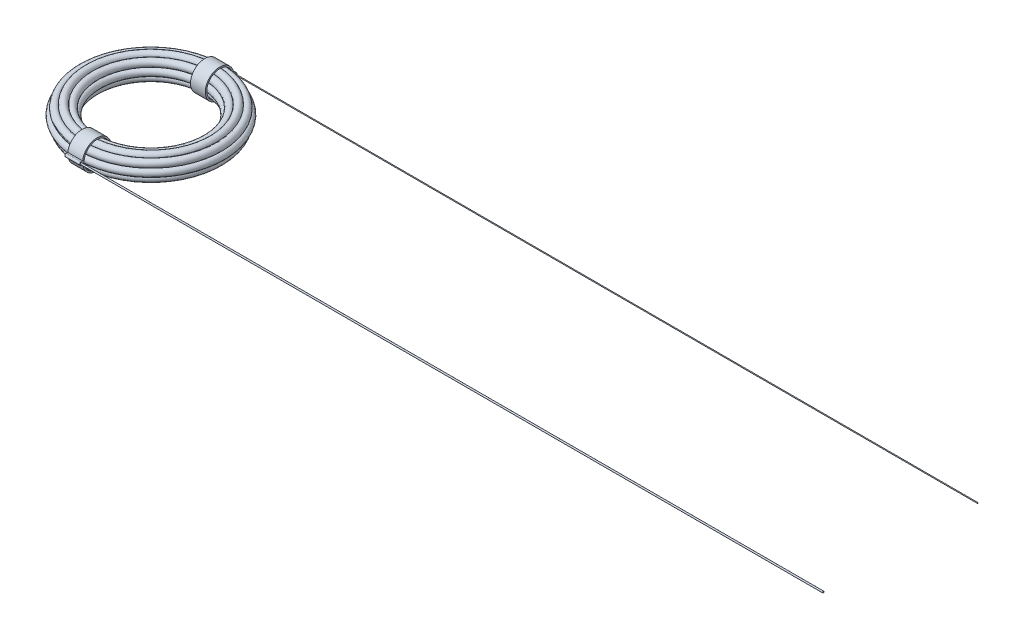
ISO-10303-21;
HEADER;
FILE_DESCRIPTION(('STEP AP214'),'2;1');
FILE_NAME('part.step','',(''),(''),'','','');
FILE_SCHEMA(('AUTOMOTIVE_DESIGN { 1 0 10303 214 1 1 1 1 }'));
ENDSEC;
DATA;
#1=APPLICATION_CONTEXT('core data for automotive mechanical design processes');
#2=APPLICATION_PROTOCOL_DEFINITION('international standard','automotive_design',2000,#1);
#3=PRODUCT_CONTEXT('',#1,'mechanical');
#4=PRODUCT('Part','Part','',(#3));
#5=PRODUCT_RELATED_PRODUCT_CATEGORY('part','',(#4));
#6=PRODUCT_DEFINITION_FORMATION('','',#4);
#7=PRODUCT_DEFINITION_CONTEXT('part definition',#1,'design');
#8=PRODUCT_DEFINITION('design','',#6,#7);
#9=PRODUCT_DEFINITION_SHAPE('','',#8);
#10=(LENGTH_UNIT() NAMED_UNIT(*) SI_UNIT(.MILLI.,.METRE.));
#11=(NAMED_UNIT(*) PLANE_ANGLE_UNIT() SI_UNIT($,.RADIAN.));
#12=(NAMED_UNIT(*) SI_UNIT($,.STERADIAN.) SOLID_ANGLE_UNIT());
#13=UNCERTAINTY_MEASURE_WITH_UNIT(LENGTH_MEASURE(1.E-05),#10,'distance_accuracy_value','');
#14=(GEOMETRIC_REPRESENTATION_CONTEXT(3) GLOBAL_UNCERTAINTY_ASSIGNED_CONTEXT((#13)) GLOBAL_UNIT_ASSIGNED_CONTEXT((#10,
#11,#12)) REPRESENTATION_CONTEXT('',''));
#15=CARTESIAN_POINT('',(0.,0.,0.));
#16=DIRECTION('',(0.,0.,1.));
#17=DIRECTION('',(1.,0.,0.));
#18=AXIS2_PLACEMENT_3D('',#15,#16,#17);
#19=CARTESIAN_POINT('',(-141.,0.,0.));
#20=DIRECTION('',(1.,0.,0.));
#21=DIRECTION('',(0.,0.,-1.));
#22=AXIS2_PLACEMENT_3D('',#19,#20,#21);
#23=CYLINDRICAL_SURFACE('',#22,5.);
#24=CARTESIAN_POINT('',(-141.,0.,0.));
#25=DIRECTION('',(-1.,0.,0.));
#26=DIRECTION('',(0.,0.,1.));
#27=AXIS2_PLACEMENT_3D('',#24,#25,#26);
#28=CIRCLE('',#27,5.);
#29=CARTESIAN_POINT('',(-141.,0.,5.));
#30=VERTEX_POINT('',#29);
#31=EDGE_CURVE('E11',#30,#30,#28,.T.);
#32=ORIENTED_EDGE('',*,*,#31,.F.);
#33=EDGE_LOOP('',(#32));
#34=FACE_BOUND('',#33,.T.);
#35=CARTESIAN_POINT('',(-140.,0.,0.));
#36=DIRECTION('',(-1.,0.,0.));
#37=DIRECTION('',(0.,0.,1.));
#38=AXIS2_PLACEMENT_3D('',#35,#36,#37);
#39=CIRCLE('',#38,5.);
#40=CARTESIAN_POINT('',(-140.,0.,5.));
#41=VERTEX_POINT('',#40);
#42=EDGE_CURVE('E42',#41,#41,#39,.T.);
#43=ORIENTED_EDGE('',*,*,#42,.T.);
#44=EDGE_LOOP('',(#43));
#45=FACE_BOUND('',#44,.T.);
#46=ADVANCED_FACE('F39',(#34,#45),#23,.T.);
#47=CARTESIAN_POINT('',(-141.,0.,0.));
#48=DIRECTION('',(-1.,0.,0.));
#49=DIRECTION('',(0.,0.,1.));
#50=AXIS2_PLACEMENT_3D('',#47,#48,#49);
#51=PLANE('',#50);
#52=ORIENTED_EDGE('',*,*,#31,.T.);
#53=EDGE_LOOP('',(#52));
#54=FACE_BOUND('',#53,.T.);
#55=ADVANCED_FACE('F54',(#54),#51,.T.);
#56=CARTESIAN_POINT('',(-140.,0.,0.));
#57=DIRECTION('',(-1.,0.,0.));
#58=DIRECTION('',(0.,0.,1.));
#59=AXIS2_PLACEMENT_3D('',#56,#57,#58);
#60=PLANE('',#59);
#61=ORIENTED_EDGE('',*,*,#42,.F.);
#62=EDGE_LOOP('',(#61));
#63=FACE_BOUND('',#62,.T.);
#64=ADVANCED_FACE('F52',(#63),#60,.F.);
#65=CLOSED_SHELL('',(#46,#55,#64));
#66=MANIFOLD_SOLID_BREP('B2',#65);
#67=CARTESIAN_POINT('',(1515.,0.,-156.));
#68=DIRECTION('',(-1.,0.,0.));
#69=DIRECTION('',(0.,0.,1.));
#70=AXIS2_PLACEMENT_3D('',#67,#68,#69);
#71=CYLINDRICAL_SURFACE('',#70,0.750000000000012);
#72=CARTESIAN_POINT('',(1515.,0.,-156.));
#73=DIRECTION('',(1.,0.,0.));
#74=DIRECTION('',(0.,0.,-1.));
#75=AXIS2_PLACEMENT_3D('',#72,#73,#74);
#76=CIRCLE('',#75,0.750000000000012);
#77=CARTESIAN_POINT('',(1515.,0.,-156.75));
#78=VERTEX_POINT('',#77);
#79=EDGE_CURVE('E38',#78,#78,#76,.T.);
#80=ORIENTED_EDGE('',*,*,#79,.F.);
#81=EDGE_LOOP('',(#80));
#82=FACE_BOUND('',#81,.T.);
#83=CARTESIAN_POINT('',(15.,0.,-156.));
#84=DIRECTION('',(1.,0.,0.));
#85=DIRECTION('',(0.,0.,-1.));
#86=AXIS2_PLACEMENT_3D('',#83,#84,#85);
#87=CIRCLE('',#86,0.750000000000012);
#88=CARTESIAN_POINT('',(15.,0.,-156.75));
#89=VERTEX_POINT('',#88);
#90=EDGE_CURVE('E90',#89,#89,#87,.T.);
#91=ORIENTED_EDGE('',*,*,#90,.T.);
#92=EDGE_LOOP('',(#91));
#93=FACE_BOUND('',#92,.T.);
#94=ADVANCED_FACE('F87',(#82,#93),#71,.T.);
#95=CARTESIAN_POINT('',(1515.,0.,-156.));
#96=DIRECTION('',(1.,0.,0.));
#97=DIRECTION('',(0.,0.,-1.));
#98=AXIS2_PLACEMENT_3D('',#95,#96,#97);
#99=PLANE('',#98);
#100=ORIENTED_EDGE('',*,*,#79,.T.);
#101=EDGE_LOOP('',(#100));
#102=FACE_BOUND('',#101,.T.);
#103=ADVANCED_FACE('F102',(#102),#99,.T.);
#104=CARTESIAN_POINT('',(15.,0.,-156.));
#105=DIRECTION('',(1.,0.,0.));
#106=DIRECTION('',(0.,0.,-1.));
#107=AXIS2_PLACEMENT_3D('',#104,#105,#106);
#108=PLANE('',#107);
#109=ORIENTED_EDGE('',*,*,#90,.F.);
#110=EDGE_LOOP('',(#109));
#111=FACE_BOUND('',#110,.T.);
#112=ADVANCED_FACE('F100',(#111),#108,.F.);
#113=CLOSED_SHELL('',(#94,#103,#112));
#114=MANIFOLD_SOLID_BREP('B6',#113);
#115=CARTESIAN_POINT('',(1515.,0.,156.));
#116=DIRECTION('',(-1.,0.,0.));
#117=DIRECTION('',(0.,0.,1.));
#118=AXIS2_PLACEMENT_3D('',#115,#116,#117);
#119=CYLINDRICAL_SURFACE('',#118,1.5);
#120=CARTESIAN_POINT('',(1515.,0.,156.));
#121=DIRECTION('',(1.,0.,0.));
#122=DIRECTION('',(0.,0.,-1.));
#123=AXIS2_PLACEMENT_3D('',#120,#121,#122);
#124=CIRCLE('',#123,1.5);
#125=CARTESIAN_POINT('',(1515.,0.,154.5));
#126=VERTEX_POINT('',#125);
#127=EDGE_CURVE('E86',#126,#126,#124,.T.);
#128=ORIENTED_EDGE('',*,*,#127,.F.);
#129=EDGE_LOOP('',(#128));
#130=FACE_BOUND('',#129,.T.);
#131=CARTESIAN_POINT('',(15.,0.,156.));
#132=DIRECTION('',(1.,0.,0.));
#133=DIRECTION('',(0.,0.,-1.));
#134=AXIS2_PLACEMENT_3D('',#131,#132,#133);
#135=CIRCLE('',#134,1.5);
#136=CARTESIAN_POINT('',(15.,0.,154.5));
#137=VERTEX_POINT('',#136);
#138=EDGE_CURVE('E140',#137,#137,#135,.T.);
#139=ORIENTED_EDGE('',*,*,#138,.T.);
#140=EDGE_LOOP('',(#139));
#141=FACE_BOUND('',#140,.T.);
#142=ADVANCED_FACE('F137',(#130,#141),#119,.T.);
#143=CARTESIAN_POINT('',(1515.,0.,156.));
#144=DIRECTION('',(1.,0.,0.));
#145=DIRECTION('',(0.,0.,-1.));
#146=AXIS2_PLACEMENT_3D('',#143,#144,#145);
#147=PLANE('',#146);
#148=ORIENTED_EDGE('',*,*,#127,.T.);
#149=EDGE_LOOP('',(#148));
#150=FACE_BOUND('',#149,.T.);
#151=ADVANCED_FACE('F152',(#150),#147,.T.);
#152=CARTESIAN_POINT('',(15.,0.,156.));
#153=DIRECTION('',(1.,0.,0.));
#154=DIRECTION('',(0.,0.,-1.));
#155=AXIS2_PLACEMENT_3D('',#152,#153,#154);
#156=PLANE('',#155);
#157=ORIENTED_EDGE('',*,*,#138,.F.);
#158=EDGE_LOOP('',(#157));
#159=FACE_BOUND('',#158,.T.);
#160=ADVANCED_FACE('F150',(#159),#156,.F.);
#161=CLOSED_SHELL('',(#142,#151,#160));
#162=MANIFOLD_SOLID_BREP('B33',#161);
#163=CARTESIAN_POINT('',(-15.,0.,-156.));
#164=DIRECTION('',(-1.,0.,0.));
#165=DIRECTION('',(0.,0.,1.));
#166=AXIS2_PLACEMENT_3D('',#163,#164,#165);
#167=PLANE('',#166);
#168=CARTESIAN_POINT('',(-15.,0.,-156.));
#169=DIRECTION('',(-1.,0.,0.));
#170=DIRECTION('',(0.,0.,1.));
#171=AXIS2_PLACEMENT_3D('',#168,#169,#170);
#172=CIRCLE('',#171,3.);
#173=CARTESIAN_POINT('',(-15.,3.,-156.));
#174=VERTEX_POINT('',#173);
#175=CARTESIAN_POINT('',(-15.,-3.,-156.));
#176=VERTEX_POINT('',#175);
#177=EDGE_CURVE('E239',#174,#176,#172,.T.);
#178=ORIENTED_EDGE('',*,*,#177,.T.);
#179=DIRECTION('',(0.,0.,1.));
#180=VECTOR('',#179,1.);
#181=CARTESIAN_POINT('',(-15.,-3.,-156.));
#182=LINE('',#181,#180);
#183=CARTESIAN_POINT('',(-15.,-3.,-152.844410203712));
#184=VERTEX_POINT('',#183);
#185=EDGE_CURVE('E234',#176,#184,#182,.T.);
#186=ORIENTED_EDGE('',*,*,#185,.T.);
#187=CARTESIAN_POINT('',(-15.,0.,-124.));
#188=DIRECTION('',(-1.,0.,0.));
#189=DIRECTION('',(0.,0.,1.));
#190=AXIS2_PLACEMENT_3D('',#187,#188,#189);
#191=CIRCLE('',#190,29.);
#192=CARTESIAN_POINT('',(-15.,2.99999999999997,-152.844410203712));
#193=VERTEX_POINT('',#192);
#194=EDGE_CURVE('E237',#184,#193,#191,.T.);
#195=ORIENTED_EDGE('',*,*,#194,.T.);
#196=DIRECTION('',(0.,0.,-1.));
#197=VECTOR('',#196,1.);
#198=CARTESIAN_POINT('',(-15.,3.,-156.));
#199=LINE('',#198,#197);
#200=EDGE_CURVE('E204',#193,#174,#199,.T.);
#201=ORIENTED_EDGE('',*,*,#200,.T.);
#202=EDGE_LOOP('',(#178,#186,#195,#201));
#203=FACE_BOUND('',#202,.T.);
#204=CARTESIAN_POINT('',(-15.,0.,-124.));
#205=DIRECTION('',(-1.,0.,0.));
#206=DIRECTION('',(0.,0.,1.));
#207=AXIS2_PLACEMENT_3D('',#204,#205,#206);
#208=CIRCLE('',#207,26.);
#209=CARTESIAN_POINT('',(-15.,0.,-98.));
#210=VERTEX_POINT('',#209);
#211=EDGE_CURVE('E254',#210,#210,#208,.T.);
#212=ORIENTED_EDGE('',*,*,#211,.F.);
#213=EDGE_LOOP('',(#212));
#214=FACE_BOUND('',#213,.T.);
#215=ADVANCED_FACE('F187',(#203,#214),#167,.T.);
#216=CARTESIAN_POINT('',(15.,0.,-156.));
#217=DIRECTION('',(-1.,0.,0.));
#218=DIRECTION('',(0.,0.,1.));
#219=AXIS2_PLACEMENT_3D('',#216,#217,#218);
#220=PLANE('',#219);
#221=CARTESIAN_POINT('',(15.,0.,-156.));
#222=DIRECTION('',(-1.,0.,0.));
#223=DIRECTION('',(0.,0.,1.));
#224=AXIS2_PLACEMENT_3D('',#221,#222,#223);
#225=CIRCLE('',#224,3.);
#226=CARTESIAN_POINT('',(15.,3.,-156.));
#227=VERTEX_POINT('',#226);
#228=CARTESIAN_POINT('',(15.,-3.,-156.));
#229=VERTEX_POINT('',#228);
#230=EDGE_CURVE('E251',#227,#229,#225,.T.);
#231=ORIENTED_EDGE('',*,*,#230,.F.);
#232=DIRECTION('',(0.,0.,-1.));
#233=VECTOR('',#232,1.);
#234=CARTESIAN_POINT('',(15.,3.,-156.));
#235=LINE('',#234,#233);
#236=CARTESIAN_POINT('',(15.,2.99999999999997,-152.844410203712));
#237=VERTEX_POINT('',#236);
#238=EDGE_CURVE('E227',#237,#227,#235,.T.);
#239=ORIENTED_EDGE('',*,*,#238,.F.);
#240=CARTESIAN_POINT('',(15.,0.,-124.));
#241=DIRECTION('',(-1.,0.,0.));
#242=DIRECTION('',(0.,0.,1.));
#243=AXIS2_PLACEMENT_3D('',#240,#241,#242);
#244=CIRCLE('',#243,29.);
#245=CARTESIAN_POINT('',(15.,-3.,-152.844410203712));
#246=VERTEX_POINT('',#245);
#247=EDGE_CURVE('E221',#246,#237,#244,.T.);
#248=ORIENTED_EDGE('',*,*,#247,.F.);
#249=DIRECTION('',(0.,0.,1.));
#250=VECTOR('',#249,1.);
#251=CARTESIAN_POINT('',(15.,-3.,-156.));
#252=LINE('',#251,#250);
#253=EDGE_CURVE('E243',#229,#246,#252,.T.);
#254=ORIENTED_EDGE('',*,*,#253,.F.);
#255=EDGE_LOOP('',(#231,#239,#248,#254));
#256=FACE_BOUND('',#255,.T.);
#257=CARTESIAN_POINT('',(15.,0.,-124.));
#258=DIRECTION('',(-1.,0.,0.));
#259=DIRECTION('',(0.,0.,1.));
#260=AXIS2_PLACEMENT_3D('',#257,#258,#259);
#261=CIRCLE('',#260,26.);
#262=CARTESIAN_POINT('',(15.,0.,-98.));
#263=VERTEX_POINT('',#262);
#264=EDGE_CURVE('E266',#263,#263,#261,.T.);
#265=ORIENTED_EDGE('',*,*,#264,.T.);
#266=EDGE_LOOP('',(#265));
#267=FACE_BOUND('',#266,.T.);
#268=ADVANCED_FACE('F262',(#256,#267),#220,.F.);
#269=CARTESIAN_POINT('',(-15.,0.,-156.));
#270=DIRECTION('',(1.,0.,0.));
#271=DIRECTION('',(0.,0.,-1.));
#272=AXIS2_PLACEMENT_3D('',#269,#270,#271);
#273=CYLINDRICAL_SURFACE('',#272,3.);
#274=ORIENTED_EDGE('',*,*,#230,.T.);
#275=DIRECTION('',(1.,0.,0.));
#276=VECTOR('',#275,1.);
#277=CARTESIAN_POINT('',(-15.,-3.,-156.));
#278=LINE('',#277,#276);
#279=EDGE_CURVE('E135',#176,#229,#278,.T.);
#280=ORIENTED_EDGE('',*,*,#279,.F.);
#281=ORIENTED_EDGE('',*,*,#177,.F.);
#282=DIRECTION('',(1.,0.,0.));
#283=VECTOR('',#282,1.);
#284=CARTESIAN_POINT('',(-15.,3.,-156.));
#285=LINE('',#284,#283);
#286=EDGE_CURVE('E247',#174,#227,#285,.T.);
#287=ORIENTED_EDGE('',*,*,#286,.T.);
#288=EDGE_LOOP('',(#274,#280,#281,#287));
#289=FACE_BOUND('',#288,.T.);
#290=ADVANCED_FACE('F189',(#289),#273,.T.);
#291=CARTESIAN_POINT('',(-15.,-3.,-156.));
#292=DIRECTION('',(0.,1.,0.));
#293=DIRECTION('',(0.,0.,-1.));
#294=AXIS2_PLACEMENT_3D('',#291,#292,#293);
#295=PLANE('',#294);
#296=ORIENTED_EDGE('',*,*,#253,.T.);
#297=DIRECTION('',(1.,0.,0.));
#298=VECTOR('',#297,1.);
#299=CARTESIAN_POINT('',(-15.,-3.,-152.844410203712));
#300=LINE('',#299,#298);
#301=EDGE_CURVE('E196',#184,#246,#300,.T.);
#302=ORIENTED_EDGE('',*,*,#301,.F.);
#303=ORIENTED_EDGE('',*,*,#185,.F.);
#304=ORIENTED_EDGE('',*,*,#279,.T.);
#305=EDGE_LOOP('',(#296,#302,#303,#304));
#306=FACE_BOUND('',#305,.T.);
#307=ADVANCED_FACE('F242',(#306),#295,.F.);
#308=CARTESIAN_POINT('',(-15.,0.,-124.));
#309=DIRECTION('',(1.,0.,0.));
#310=DIRECTION('',(0.,0.,-1.));
#311=AXIS2_PLACEMENT_3D('',#308,#309,#310);
#312=CYLINDRICAL_SURFACE('',#311,29.);
#313=ORIENTED_EDGE('',*,*,#247,.T.);
#314=DIRECTION('',(1.,0.,0.));
#315=VECTOR('',#314,1.);
#316=CARTESIAN_POINT('',(-15.,2.99999999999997,-152.844410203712));
#317=LINE('',#316,#315);
#318=EDGE_CURVE('E244',#193,#237,#317,.T.);
#319=ORIENTED_EDGE('',*,*,#318,.F.);
#320=ORIENTED_EDGE('',*,*,#194,.F.);
#321=ORIENTED_EDGE('',*,*,#301,.T.);
#322=EDGE_LOOP('',(#313,#319,#320,#321));
#323=FACE_BOUND('',#322,.T.);
#324=ADVANCED_FACE('F245',(#323),#312,.T.);
#325=CARTESIAN_POINT('',(-15.,3.,-156.));
#326=DIRECTION('',(0.,-1.,0.));
#327=DIRECTION('',(0.,0.,1.));
#328=AXIS2_PLACEMENT_3D('',#325,#326,#327);
#329=PLANE('',#328);
#330=ORIENTED_EDGE('',*,*,#238,.T.);
#331=ORIENTED_EDGE('',*,*,#286,.F.);
#332=ORIENTED_EDGE('',*,*,#200,.F.);
#333=ORIENTED_EDGE('',*,*,#318,.T.);
#334=EDGE_LOOP('',(#330,#331,#332,#333));
#335=FACE_BOUND('',#334,.T.);
#336=ADVANCED_FACE('F259',(#335),#329,.F.);
#337=CARTESIAN_POINT('',(-15.,0.,-124.));
#338=DIRECTION('',(1.,0.,0.));
#339=DIRECTION('',(0.,0.,-1.));
#340=AXIS2_PLACEMENT_3D('',#337,#338,#339);
#341=CYLINDRICAL_SURFACE('',#340,26.);
#342=ORIENTED_EDGE('',*,*,#211,.T.);
#343=EDGE_LOOP('',(#342));
#344=FACE_BOUND('',#343,.T.);
#345=ORIENTED_EDGE('',*,*,#264,.F.);
#346=EDGE_LOOP('',(#345));
#347=FACE_BOUND('',#346,.T.);
#348=ADVANCED_FACE('F272',(#344,#347),#341,.F.);
#349=CLOSED_SHELL('',(#215,#268,#290,#307,#324,#336,#348));
#350=MANIFOLD_SOLID_BREP('B81',#349);
#351=CARTESIAN_POINT('',(15.,0.,156.));
#352=DIRECTION('',(1.,0.,0.));
#353=DIRECTION('',(0.,0.,-1.));
#354=AXIS2_PLACEMENT_3D('',#351,#352,#353);
#355=PLANE('',#354);
#356=CARTESIAN_POINT('',(15.,0.,156.));
#357=DIRECTION('',(1.,0.,0.));
#358=DIRECTION('',(0.,0.,-1.));
#359=AXIS2_PLACEMENT_3D('',#356,#357,#358);
#360=CIRCLE('',#359,3.);
#361=CARTESIAN_POINT('',(15.,3.,156.));
#362=VERTEX_POINT('',#361);
#363=CARTESIAN_POINT('',(15.,-3.,156.));
#364=VERTEX_POINT('',#363);
#365=EDGE_CURVE('E392',#362,#364,#360,.T.);
#366=ORIENTED_EDGE('',*,*,#365,.T.);
#367=DIRECTION('',(0.,0.,-1.));
#368=VECTOR('',#367,1.);
#369=CARTESIAN_POINT('',(15.,-3.,156.));
#370=LINE('',#369,#368);
#371=CARTESIAN_POINT('',(15.,-3.,152.844410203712));
#372=VERTEX_POINT('',#371);
#373=EDGE_CURVE('E387',#364,#372,#370,.T.);
#374=ORIENTED_EDGE('',*,*,#373,.T.);
#375=CARTESIAN_POINT('',(15.,0.,124.));
#376=DIRECTION('',(1.,0.,0.));
#377=DIRECTION('',(0.,0.,-1.));
#378=AXIS2_PLACEMENT_3D('',#375,#376,#377);
#379=CIRCLE('',#378,29.);
#380=CARTESIAN_POINT('',(15.,2.99999999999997,152.844410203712));
#381=VERTEX_POINT('',#380);
#382=EDGE_CURVE('E390',#372,#381,#379,.T.);
#383=ORIENTED_EDGE('',*,*,#382,.T.);
#384=DIRECTION('',(0.,0.,1.));
#385=VECTOR('',#384,1.);
#386=CARTESIAN_POINT('',(15.,3.,156.));
#387=LINE('',#386,#385);
#388=EDGE_CURVE('E357',#381,#362,#387,.T.);
#389=ORIENTED_EDGE('',*,*,#388,.T.);
#390=EDGE_LOOP('',(#366,#374,#383,#389));
#391=FACE_BOUND('',#390,.T.);
#392=CARTESIAN_POINT('',(15.,0.,124.));
#393=DIRECTION('',(1.,0.,0.));
#394=DIRECTION('',(0.,0.,-1.));
#395=AXIS2_PLACEMENT_3D('',#392,#393,#394);
#396=CIRCLE('',#395,26.);
#397=CARTESIAN_POINT('',(15.,0.,98.));
#398=VERTEX_POINT('',#397);
#399=EDGE_CURVE('E407',#398,#398,#396,.T.);
#400=ORIENTED_EDGE('',*,*,#399,.F.);
#401=EDGE_LOOP('',(#400));
#402=FACE_BOUND('',#401,.T.);
#403=ADVANCED_FACE('F340',(#391,#402),#355,.T.);
#404=CARTESIAN_POINT('',(-15.,0.,156.));
#405=DIRECTION('',(1.,0.,0.));
#406=DIRECTION('',(0.,0.,-1.));
#407=AXIS2_PLACEMENT_3D('',#404,#405,#406);
#408=PLANE('',#407);
#409=CARTESIAN_POINT('',(-15.,0.,156.));
#410=DIRECTION('',(1.,0.,0.));
#411=DIRECTION('',(0.,0.,-1.));
#412=AXIS2_PLACEMENT_3D('',#409,#410,#411);
#413=CIRCLE('',#412,3.);
#414=CARTESIAN_POINT('',(-15.,3.,156.));
#415=VERTEX_POINT('',#414);
#416=CARTESIAN_POINT('',(-15.,-3.,156.));
#417=VERTEX_POINT('',#416);
#418=EDGE_CURVE('E404',#415,#417,#413,.T.);
#419=ORIENTED_EDGE('',*,*,#418,.F.);
#420=DIRECTION('',(0.,0.,1.));
#421=VECTOR('',#420,1.);
#422=CARTESIAN_POINT('',(-15.,3.,156.));
#423=LINE('',#422,#421);
#424=CARTESIAN_POINT('',(-15.,2.99999999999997,152.844410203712));
#425=VERTEX_POINT('',#424);
#426=EDGE_CURVE('E380',#425,#415,#423,.T.);
#427=ORIENTED_EDGE('',*,*,#426,.F.);
#428=CARTESIAN_POINT('',(-15.,0.,124.));
#429=DIRECTION('',(1.,0.,0.));
#430=DIRECTION('',(0.,0.,-1.));
#431=AXIS2_PLACEMENT_3D('',#428,#429,#430);
#432=CIRCLE('',#431,29.);
#433=CARTESIAN_POINT('',(-15.,-3.,152.844410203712));
#434=VERTEX_POINT('',#433);
#435=EDGE_CURVE('E374',#434,#425,#432,.T.);
#436=ORIENTED_EDGE('',*,*,#435,.F.);
#437=DIRECTION('',(0.,0.,-1.));
#438=VECTOR('',#437,1.);
#439=CARTESIAN_POINT('',(-15.,-3.,156.));
#440=LINE('',#439,#438);
#441=EDGE_CURVE('E396',#417,#434,#440,.T.);
#442=ORIENTED_EDGE('',*,*,#441,.F.);
#443=EDGE_LOOP('',(#419,#427,#436,#442));
#444=FACE_BOUND('',#443,.T.);
#445=CARTESIAN_POINT('',(-15.,0.,124.));
#446=DIRECTION('',(1.,0.,0.));
#447=DIRECTION('',(0.,0.,-1.));
#448=AXIS2_PLACEMENT_3D('',#445,#446,#447);
#449=CIRCLE('',#448,26.);
#450=CARTESIAN_POINT('',(-15.,0.,98.));
#451=VERTEX_POINT('',#450);
#452=EDGE_CURVE('E419',#451,#451,#449,.T.);
#453=ORIENTED_EDGE('',*,*,#452,.T.);
#454=EDGE_LOOP('',(#453));
#455=FACE_BOUND('',#454,.T.);
#456=ADVANCED_FACE('F415',(#444,#455),#408,.F.);
#457=CARTESIAN_POINT('',(15.,0.,156.));
#458=DIRECTION('',(-1.,0.,0.));
#459=DIRECTION('',(0.,0.,1.));
#460=AXIS2_PLACEMENT_3D('',#457,#458,#459);
#461=CYLINDRICAL_SURFACE('',#460,3.);
#462=ORIENTED_EDGE('',*,*,#418,.T.);
#463=DIRECTION('',(-1.,0.,0.));
#464=VECTOR('',#463,1.);
#465=CARTESIAN_POINT('',(15.,-3.,156.));
#466=LINE('',#465,#464);
#467=EDGE_CURVE('E185',#364,#417,#466,.T.);
#468=ORIENTED_EDGE('',*,*,#467,.F.);
#469=ORIENTED_EDGE('',*,*,#365,.F.);
#470=DIRECTION('',(-1.,0.,0.));
#471=VECTOR('',#470,1.);
#472=CARTESIAN_POINT('',(15.,3.,156.));
#473=LINE('',#472,#471);
#474=EDGE_CURVE('E400',#362,#415,#473,.T.);
#475=ORIENTED_EDGE('',*,*,#474,.T.);
#476=EDGE_LOOP('',(#462,#468,#469,#475));
#477=FACE_BOUND('',#476,.T.);
#478=ADVANCED_FACE('F342',(#477),#461,.T.);
#479=CARTESIAN_POINT('',(15.,-3.,156.));
#480=DIRECTION('',(0.,1.,0.));
#481=DIRECTION('',(0.,0.,1.));
#482=AXIS2_PLACEMENT_3D('',#479,#480,#481);
#483=PLANE('',#482);
#484=ORIENTED_EDGE('',*,*,#441,.T.);
#485=DIRECTION('',(-1.,0.,0.));
#486=VECTOR('',#485,1.);
#487=CARTESIAN_POINT('',(15.,-3.,152.844410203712));
#488=LINE('',#487,#486);
#489=EDGE_CURVE('E349',#372,#434,#488,.T.);
#490=ORIENTED_EDGE('',*,*,#489,.F.);
#491=ORIENTED_EDGE('',*,*,#373,.F.);
#492=ORIENTED_EDGE('',*,*,#467,.T.);
#493=EDGE_LOOP('',(#484,#490,#491,#492));
#494=FACE_BOUND('',#493,.T.);
#495=ADVANCED_FACE('F395',(#494),#483,.F.);
#496=CARTESIAN_POINT('',(15.,0.,124.));
#497=DIRECTION('',(-1.,0.,0.));
#498=DIRECTION('',(0.,0.,1.));
#499=AXIS2_PLACEMENT_3D('',#496,#497,#498);
#500=CYLINDRICAL_SURFACE('',#499,29.);
#501=ORIENTED_EDGE('',*,*,#435,.T.);
#502=DIRECTION('',(-1.,0.,0.));
#503=VECTOR('',#502,1.);
#504=CARTESIAN_POINT('',(15.,2.99999999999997,152.844410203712));
#505=LINE('',#504,#503);
#506=EDGE_CURVE('E397',#381,#425,#505,.T.);
#507=ORIENTED_EDGE('',*,*,#506,.F.);
#508=ORIENTED_EDGE('',*,*,#382,.F.);
#509=ORIENTED_EDGE('',*,*,#489,.T.);
#510=EDGE_LOOP('',(#501,#507,#508,#509));
#511=FACE_BOUND('',#510,.T.);
#512=ADVANCED_FACE('F398',(#511),#500,.T.);
#513=CARTESIAN_POINT('',(15.,3.,156.));
#514=DIRECTION('',(0.,-1.,0.));
#515=DIRECTION('',(0.,0.,-1.));
#516=AXIS2_PLACEMENT_3D('',#513,#514,#515);
#517=PLANE('',#516);
#518=ORIENTED_EDGE('',*,*,#426,.T.);
#519=ORIENTED_EDGE('',*,*,#474,.F.);
#520=ORIENTED_EDGE('',*,*,#388,.F.);
#521=ORIENTED_EDGE('',*,*,#506,.T.);
#522=EDGE_LOOP('',(#518,#519,#520,#521));
#523=FACE_BOUND('',#522,.T.);
#524=ADVANCED_FACE('F412',(#523),#517,.F.);
#525=CARTESIAN_POINT('',(15.,0.,124.));
#526=DIRECTION('',(-1.,0.,0.));
#527=DIRECTION('',(0.,0.,1.));
#528=AXIS2_PLACEMENT_3D('',#525,#526,#527);
#529=CYLINDRICAL_SURFACE('',#528,26.);
#530=ORIENTED_EDGE('',*,*,#399,.T.);
#531=EDGE_LOOP('',(#530));
#532=FACE_BOUND('',#531,.T.);
#533=ORIENTED_EDGE('',*,*,#452,.F.);
#534=EDGE_LOOP('',(#533));
#535=FACE_BOUND('',#534,.T.);
#536=ADVANCED_FACE('F425',(#532,#535),#529,.F.);
#537=CLOSED_SHELL('',(#403,#456,#478,#495,#512,#524,#536));
#538=MANIFOLD_SOLID_BREP('B129',#537);
#539=CARTESIAN_POINT('',(0.,12.3743686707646,0.));
#540=DIRECTION('',(0.,1.,0.));
#541=DIRECTION('',(0.,0.,1.));
#542=AXIS2_PLACEMENT_3D('',#539,#540,#541);
#543=TOROIDAL_SURFACE('',#542,137.374368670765,7.49999999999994);
#544=CARTESIAN_POINT('',(0.,18.0566599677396,0.));
#545=DIRECTION('',(0.,1.,0.));
#546=DIRECTION('',(0.,0.,1.));
#547=AXIS2_PLACEMENT_3D('',#544,#545,#546);
#548=CIRCLE('',#547,132.479313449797);
#549=CARTESIAN_POINT('',(0.,18.0566599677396,132.479313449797));
#550=VERTEX_POINT('',#549);
#551=EDGE_CURVE('E498',#550,#550,#548,.T.);
#552=ORIENTED_EDGE('',*,*,#551,.F.);
#553=EDGE_LOOP('',(#552));
#554=FACE_BOUND('',#553,.T.);
#555=CARTESIAN_POINT('',(0.,7.4793134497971,0.));
#556=DIRECTION('',(0.,1.,0.));
#557=DIRECTION('',(0.,0.,1.));
#558=AXIS2_PLACEMENT_3D('',#555,#556,#557);
#559=CIRCLE('',#558,143.05665996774);
#560=CARTESIAN_POINT('',(-142.90519292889,7.47931344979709,6.58132168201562));
#561=VERTEX_POINT('',#560);
#562=CARTESIAN_POINT('',(-142.90519292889,7.4793134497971,-6.58132168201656));
#563=VERTEX_POINT('',#562);
#564=EDGE_CURVE('E525',#561,#563,#559,.T.);
#565=ORIENTED_EDGE('',*,*,#564,.T.);
#566=CARTESIAN_POINT('',(-142.90519292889,7.4793134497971,-6.58132168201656));
#567=CARTESIAN_POINT('',(-142.955282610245,7.53611148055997,-6.55742139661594));
#568=CARTESIAN_POINT('',(-143.003789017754,7.5926187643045,-6.52970718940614));
#569=CARTESIAN_POINT('',(-143.097441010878,7.70443523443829,-6.46744631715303));
#570=CARTESIAN_POINT('',(-143.142593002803,7.75974655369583,-6.43291316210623));
#571=CARTESIAN_POINT('',(-143.228969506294,7.86806687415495,-6.3582029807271));
#572=CARTESIAN_POINT('',(-143.270237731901,7.92109654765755,-6.31810584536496));
#573=CARTESIAN_POINT('',(-143.349580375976,8.02531245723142,-6.23264583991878));
#574=CARTESIAN_POINT('',(-143.387652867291,8.07649757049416,-6.18727983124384));
#575=CARTESIAN_POINT('',(-143.472831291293,8.19341671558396,-6.07616834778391));
#576=CARTESIAN_POINT('',(-143.51874331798,8.25834334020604,-6.00865521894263));
#577=CARTESIAN_POINT('',(-143.60549443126,8.38418336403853,-5.8670085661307));
#578=CARTESIAN_POINT('',(-143.646332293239,8.44509579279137,-5.7928734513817));
#579=CARTESIAN_POINT('',(-143.762458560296,8.62240769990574,-5.56148385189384));
#580=CARTESIAN_POINT('',(-143.830832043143,8.73264023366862,-5.39597516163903));
#581=CARTESIAN_POINT('',(-143.942758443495,8.92016052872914,-5.0794113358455));
#582=CARTESIAN_POINT('',(-143.988546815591,8.99988066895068,-4.93050521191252));
#583=CARTESIAN_POINT('',(-144.071824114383,9.14910404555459,-4.62532358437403));
#584=CARTESIAN_POINT('',(-144.109307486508,9.21860043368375,-4.46904323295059));
#585=CARTESIAN_POINT('',(-144.177387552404,9.34803559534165,-4.15115907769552));
#586=CARTESIAN_POINT('',(-144.207983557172,9.40797341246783,-3.98955474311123));
#587=CARTESIAN_POINT('',(-144.263420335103,9.51896800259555,-3.66233701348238));
#588=CARTESIAN_POINT('',(-144.288259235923,9.57002188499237,-3.49672233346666));
#589=CARTESIAN_POINT('',(-144.349131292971,9.69742535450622,-3.04256921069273));
#590=CARTESIAN_POINT('',(-144.380409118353,9.76564177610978,-2.75109238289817));
#591=CARTESIAN_POINT('',(-144.431715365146,9.87979124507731,-2.16277001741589));
#592=CARTESIAN_POINT('',(-144.451735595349,9.92570806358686,-1.8659207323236));
#593=CARTESIAN_POINT('',(-144.482382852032,9.9968070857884,-1.26825187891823));
#594=CARTESIAN_POINT('',(-144.492977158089,10.0219170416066,-0.96742213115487));
#595=CARTESIAN_POINT('',(-144.505555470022,10.0517985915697,-0.36469062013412));
#596=CARTESIAN_POINT('',(-144.507542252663,10.0565767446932,-0.0627892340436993));
#597=CARTESIAN_POINT('',(-144.502946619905,10.0456090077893,0.55620771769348));
#598=CARTESIAN_POINT('',(-144.495915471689,10.028788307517,0.873281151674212));
#599=CARTESIAN_POINT('',(-144.471884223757,9.97234046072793,1.5052790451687));
#600=CARTESIAN_POINT('',(-144.454878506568,9.93270046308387,1.82020219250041));
#601=CARTESIAN_POINT('',(-144.420660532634,9.85525464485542,2.28800013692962));
#602=CARTESIAN_POINT('',(-144.407850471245,9.82654607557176,2.44274523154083));
#603=CARTESIAN_POINT('',(-144.378989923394,9.76287888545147,2.75063075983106));
#604=CARTESIAN_POINT('',(-144.362939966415,9.72792128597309,2.90377145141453));
#605=CARTESIAN_POINT('',(-144.327183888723,9.65145970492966,3.20781359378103));
#606=CARTESIAN_POINT('',(-144.307481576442,9.60996254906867,3.35871720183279));
#607=CARTESIAN_POINT('',(-144.263872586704,9.52004386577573,3.65780481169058));
#608=CARTESIAN_POINT('',(-144.239967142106,9.47162436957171,3.80598959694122));
#609=CARTESIAN_POINT('',(-144.19408351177,9.38092001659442,4.06095762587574));
#610=CARTESIAN_POINT('',(-144.173207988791,9.34029109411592,4.16852949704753));
#611=CARTESIAN_POINT('',(-144.128421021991,9.25479507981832,4.38133191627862));
#612=CARTESIAN_POINT('',(-144.1045098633,9.20992838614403,4.48656268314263));
#613=CARTESIAN_POINT('',(-144.053170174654,9.11560684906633,4.6944526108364));
#614=CARTESIAN_POINT('',(-144.025732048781,9.06613959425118,4.79710380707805));
#615=CARTESIAN_POINT('',(-143.966901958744,8.96249402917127,4.99885443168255));
#616=CARTESIAN_POINT('',(-143.935509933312,8.90831564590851,5.09795380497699));
#617=CARTESIAN_POINT('',(-143.867715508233,8.79420737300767,5.29313663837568));
#618=CARTESIAN_POINT('',(-143.831246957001,8.73420537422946,5.38915538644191));
#619=CARTESIAN_POINT('',(-143.75297144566,8.60893298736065,5.57548710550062));
#620=CARTESIAN_POINT('',(-143.711163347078,8.54366147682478,5.66579885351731));
#621=CARTESIAN_POINT('',(-143.621800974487,8.40827860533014,5.83856460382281));
#622=CARTESIAN_POINT('',(-143.574289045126,8.33820438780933,5.92106926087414));
#623=CARTESIAN_POINT('',(-143.472604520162,8.19300885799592,6.07701147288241));
#624=CARTESIAN_POINT('',(-143.418438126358,8.11789227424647,6.15045734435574));
#625=CARTESIAN_POINT('',(-143.327715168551,7.99639433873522,6.25695742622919));
#626=CARTESIAN_POINT('',(-143.293578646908,7.95151730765,6.29381804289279));
#627=CARTESIAN_POINT('',(-143.222914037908,7.8604907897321,6.36340707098));
#628=CARTESIAN_POINT('',(-143.186387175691,7.81434196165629,6.39613757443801));
#629=CARTESIAN_POINT('',(-143.110518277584,7.7204949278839,6.45733754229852));
#630=CARTESIAN_POINT('',(-143.071150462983,7.67278547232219,6.48575805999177));
#631=CARTESIAN_POINT('',(-142.989973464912,7.57655751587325,6.53749866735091));
#632=CARTESIAN_POINT('',(-142.948160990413,7.52803799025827,6.56081167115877));
#633=CARTESIAN_POINT('',(-142.90519292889,7.47931344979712,6.58132168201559));
#634=B_SPLINE_CURVE_WITH_KNOTS('',3,(#566,#567,#568,#569,#570,#571,#572,#573,#574,#575,#576,
#577,#578,#579,#580,#581,#582,#583,#584,#585,#586,#587,#588,#589,#590,#591,#592,#593,#594,#595,
#596,#597,#598,#599,#600,#601,#602,#603,#604,#605,#606,#607,#608,#609,#610,#611,#612,#613,#614,
#615,#616,#617,#618,#619,#620,#621,#622,#623,#624,#625,#626,#627,#628,#629,#630,#631,#632,#633),
.UNSPECIFIED.,.F.,.F.,(4,2,2,2,2,2,2,2,2,2,2,2,2,2,2,2,2,2,2,2,2,2,2,2,2,2,2,2,2,2,2,2,2,4),(0.,
0.238043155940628,0.475619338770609,0.710082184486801,0.944685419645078,1.25712645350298,
1.56964274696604,2.1981336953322,2.72248870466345,3.24719336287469,3.7719504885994,
4.29687803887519,5.19844084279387,6.10065879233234,7.00599654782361,7.91104222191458,
8.86291948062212,9.81533333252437,10.2889192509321,10.7624278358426,11.2354454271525,
11.7083245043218,12.05880835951,12.4092593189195,12.7606847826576,13.1121156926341,
13.4686510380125,13.8252625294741,14.1793736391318,14.5331571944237,14.7350962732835,
14.9369326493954,15.1409126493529,15.3451738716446),.UNSPECIFIED.);
#635=EDGE_CURVE('E509',#563,#561,#634,.T.);
#636=ORIENTED_EDGE('',*,*,#635,.T.);
#637=EDGE_LOOP('',(#565,#636));
#638=FACE_BOUND('',#637,.T.);
#639=ADVANCED_FACE('F484',(#554,#638),#543,.T.);
#640=CARTESIAN_POINT('',(0.,0.,0.));
#641=DIRECTION('',(0.,1.,0.));
#642=DIRECTION('',(0.,0.,1.));
#643=AXIS2_PLACEMENT_3D('',#640,#641,#642);
#644=TOROIDAL_SURFACE('',#643,142.5,7.49999999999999);
#645=CARTESIAN_POINT('',(0.,-7.4793134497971,0.));
#646=DIRECTION('',(0.,1.,0.));
#647=DIRECTION('',(0.,0.,1.));
#648=AXIS2_PLACEMENT_3D('',#645,#646,#647);
#649=CIRCLE('',#648,143.05665996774);
#650=CARTESIAN_POINT('',(-142.90519292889,-7.4793134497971,6.58132168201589));
#651=VERTEX_POINT('',#650);
#652=CARTESIAN_POINT('',(-142.90519292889,-7.4793134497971,-6.58132168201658));
#653=VERTEX_POINT('',#652);
#654=EDGE_CURVE('E523',#651,#653,#649,.T.);
#655=ORIENTED_EDGE('',*,*,#654,.T.);
#656=CARTESIAN_POINT('',(-142.90519292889,-7.4793134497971,-6.58132168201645));
#657=CARTESIAN_POINT('',(-142.964066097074,-7.47436425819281,-6.74884757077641));
#658=CARTESIAN_POINT('',(-143.024174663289,-7.46840841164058,-6.91590425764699));
#659=CARTESIAN_POINT('',(-143.14663673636,-7.45426034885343,-7.24910029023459));
#660=CARTESIAN_POINT('',(-143.208990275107,-7.44606810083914,-7.41523962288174));
#661=CARTESIAN_POINT('',(-143.399932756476,-7.41767515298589,-7.91454384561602));
#662=CARTESIAN_POINT('',(-143.531602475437,-7.3937188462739,-8.24633275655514));
#663=CARTESIAN_POINT('',(-143.802165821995,-7.3339414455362,-8.90743441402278));
#664=CARTESIAN_POINT('',(-143.941086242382,-7.29807326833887,-9.2367319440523));
#665=CARTESIAN_POINT('',(-144.22430955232,-7.21272221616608,-9.89184765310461));
#666=CARTESIAN_POINT('',(-144.368620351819,-7.16321859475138,-10.2176597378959));
#667=CARTESIAN_POINT('',(-144.667044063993,-7.04653419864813,-10.877801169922));
#668=CARTESIAN_POINT('',(-144.821317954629,-6.97872391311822,-11.2119478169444));
#669=CARTESIAN_POINT('',(-145.132532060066,-6.8243995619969,-11.8739401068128));
#670=CARTESIAN_POINT('',(-145.289467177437,-6.73791819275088,-12.2017956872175));
#671=CARTESIAN_POINT('',(-145.604317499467,-6.5440962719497,-12.84991460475));
#672=CARTESIAN_POINT('',(-145.762229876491,-6.43680090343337,-13.1701927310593));
#673=CARTESIAN_POINT('',(-146.077602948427,-6.19870862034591,-13.8017103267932));
#674=CARTESIAN_POINT('',(-146.235063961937,-6.06794156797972,-14.1129607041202));
#675=CARTESIAN_POINT('',(-146.471109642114,-5.85041533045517,-14.574435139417));
#676=CARTESIAN_POINT('',(-146.550560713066,-5.77346337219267,-14.7288755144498));
#677=CARTESIAN_POINT('',(-146.708545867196,-5.61219135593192,-15.0344077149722));
#678=CARTESIAN_POINT('',(-146.787079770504,-5.52786987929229,-15.1854988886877));
#679=CARTESIAN_POINT('',(-146.942861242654,-5.35139530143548,-15.4838012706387));
#680=CARTESIAN_POINT('',(-147.020108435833,-5.25923995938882,-15.6310113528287));
#681=CARTESIAN_POINT('',(-147.172279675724,-5.06737231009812,-15.9197562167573));
#682=CARTESIAN_POINT('',(-147.247216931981,-4.96772287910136,-16.0613256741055));
#683=CARTESIAN_POINT('',(-147.394871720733,-4.75979569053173,-16.3391566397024));
#684=CARTESIAN_POINT('',(-147.467589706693,-4.65151971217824,-16.4754192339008));
#685=CARTESIAN_POINT('',(-147.610199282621,-4.42590615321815,-16.7416799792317));
#686=CARTESIAN_POINT('',(-147.680092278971,-4.30857316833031,-16.8716812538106));
#687=CARTESIAN_POINT('',(-147.81139394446,-4.07332789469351,-17.1151124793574));
#688=CARTESIAN_POINT('',(-147.873048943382,-3.95608892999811,-17.2290585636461));
#689=CARTESIAN_POINT('',(-147.992738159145,-3.71310211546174,-17.4496661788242));
#690=CARTESIAN_POINT('',(-148.050771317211,-3.58735179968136,-17.5563255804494));
#691=CARTESIAN_POINT('',(-148.162446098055,-3.32720902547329,-17.7610904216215));
#692=CARTESIAN_POINT('',(-148.216087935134,-3.19281698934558,-17.8591962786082));
#693=CARTESIAN_POINT('',(-148.318107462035,-2.91545349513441,-18.0453974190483));
#694=CARTESIAN_POINT('',(-148.36648840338,-2.77248742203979,-18.1334988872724));
#695=CARTESIAN_POINT('',(-148.448625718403,-2.50565006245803,-18.2828015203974));
#696=CARTESIAN_POINT('',(-148.483426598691,-2.38319205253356,-18.3459549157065));
#697=CARTESIAN_POINT('',(-148.548398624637,-2.13309976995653,-18.4637157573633));
#698=CARTESIAN_POINT('',(-148.578572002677,-2.00546803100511,-18.518327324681));
#699=CARTESIAN_POINT('',(-148.633759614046,-1.74552819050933,-18.6181133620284));
#700=CARTESIAN_POINT('',(-148.658775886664,-1.61322196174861,-18.663291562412));
#701=CARTESIAN_POINT('',(-148.703156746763,-1.34459541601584,-18.743383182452));
#702=CARTESIAN_POINT('',(-148.722521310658,-1.20827508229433,-18.7782965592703));
#703=CARTESIAN_POINT('',(-148.755282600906,-0.931504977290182,-18.837337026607));
#704=CARTESIAN_POINT('',(-148.768633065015,-0.791031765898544,-18.8613805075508));
#705=CARTESIAN_POINT('',(-148.788815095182,-0.508100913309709,-18.8977212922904));
#706=CARTESIAN_POINT('',(-148.795646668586,-0.365643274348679,-18.9100186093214));
#707=CARTESIAN_POINT('',(-148.802609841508,-0.0800824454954,-18.9225528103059));
#708=CARTESIAN_POINT('',(-148.802743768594,0.0630205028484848,-18.9227938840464));
#709=CARTESIAN_POINT('',(-148.796313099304,0.348577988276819,-18.9112183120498));
#710=CARTESIAN_POINT('',(-148.78974899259,0.49103257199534,-18.8994025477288));
#711=CARTESIAN_POINT('',(-148.771249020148,0.757445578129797,-18.8660911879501));
#712=CARTESIAN_POINT('',(-148.760031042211,0.881618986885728,-18.8458890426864));
#713=CARTESIAN_POINT('',(-148.732726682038,1.12770944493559,-18.7966911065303));
#714=CARTESIAN_POINT('',(-148.716638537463,1.24962566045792,-18.7676921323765));
#715=CARTESIAN_POINT('',(-148.679889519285,1.49046349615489,-18.7014016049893));
#716=CARTESIAN_POINT('',(-148.659228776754,1.60938520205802,-18.6641102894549));
#717=CARTESIAN_POINT('',(-148.613677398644,1.8437051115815,-18.5818129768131));
#718=CARTESIAN_POINT('',(-148.588785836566,1.95910253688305,-18.5368052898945));
#719=CARTESIAN_POINT('',(-148.525798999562,2.22544960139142,-18.4227840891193));
#720=CARTESIAN_POINT('',(-148.486123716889,2.37479179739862,-18.3508678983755));
#721=CARTESIAN_POINT('',(-148.400691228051,2.66560635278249,-18.1957121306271));
#722=CARTESIAN_POINT('',(-148.354932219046,2.80707636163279,-18.1124691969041));
#723=CARTESIAN_POINT('',(-148.209713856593,3.21959231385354,-17.8477208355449));
#724=CARTESIAN_POINT('',(-148.102381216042,3.47846836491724,-17.6513186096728));
#725=CARTESIAN_POINT('',(-147.903008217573,3.90018536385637,-17.2844547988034));
#726=CARTESIAN_POINT('',(-147.814240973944,4.07050167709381,-17.1205130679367));
#727=CARTESIAN_POINT('',(-147.63057740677,4.39426321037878,-16.7797186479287));
#728=CARTESIAN_POINT('',(-147.53567811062,4.54770014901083,-16.6028596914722));
#729=CARTESIAN_POINT('',(-147.341287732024,4.83878487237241,-16.2386367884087));
#730=CARTESIAN_POINT('',(-147.241790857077,4.97641193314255,-16.0512595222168));
#731=CARTESIAN_POINT('',(-147.039573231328,5.23682891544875,-15.66819830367));
#732=CARTESIAN_POINT('',(-146.936852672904,5.35961972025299,-15.4725148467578));
#733=CARTESIAN_POINT('',(-146.716306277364,5.60590104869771,-15.0496454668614));
#734=CARTESIAN_POINT('',(-146.598188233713,5.72758624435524,-14.8215643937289));
#735=CARTESIAN_POINT('',(-146.360283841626,5.95519953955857,-14.3583658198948));
#736=CARTESIAN_POINT('',(-146.240496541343,6.06111820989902,-14.1232442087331));
#737=CARTESIAN_POINT('',(-146.000277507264,6.25850390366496,-13.6472826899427));
#738=CARTESIAN_POINT('',(-145.87984562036,6.3499673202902,-13.4064413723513));
#739=CARTESIAN_POINT('',(-145.638706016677,6.51999273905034,-12.9192311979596));
#740=CARTESIAN_POINT('',(-145.517998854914,6.59850740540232,-12.6728456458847));
#741=CARTESIAN_POINT('',(-145.27749339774,6.74335845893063,-12.1762099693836));
#742=CARTESIAN_POINT('',(-145.157694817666,6.80969882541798,-11.9259611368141));
#743=CARTESIAN_POINT('',(-144.919691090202,6.93125368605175,-11.4220718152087));
#744=CARTESIAN_POINT('',(-144.801485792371,6.98646923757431,-11.1684316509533));
#745=CARTESIAN_POINT('',(-144.57630683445,7.08289882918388,-10.6778339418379));
#746=CARTESIAN_POINT('',(-144.469169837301,7.12486413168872,-10.441097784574));
#747=CARTESIAN_POINT('',(-144.257217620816,7.20090002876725,-9.9653322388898));
#748=CARTESIAN_POINT('',(-144.152402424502,7.2349705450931,-9.72630282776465));
#749=CARTESIAN_POINT('',(-143.945600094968,7.29591009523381,-9.24608737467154));
#750=CARTESIAN_POINT('',(-143.843613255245,7.32277838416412,-9.00490111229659));
#751=CARTESIAN_POINT('',(-143.644253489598,7.36971067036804,-8.52322828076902));
#752=CARTESIAN_POINT('',(-143.546841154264,7.38984892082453,-8.28276521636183));
#753=CARTESIAN_POINT('',(-143.355974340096,7.4244116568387,-7.79990524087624));
#754=CARTESIAN_POINT('',(-143.262519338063,7.43883689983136,-7.55750859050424));
#755=CARTESIAN_POINT('',(-143.080235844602,7.46266506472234,-7.07084217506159));
#756=CARTESIAN_POINT('',(-142.991405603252,7.47206989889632,-6.8265731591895));
#757=CARTESIAN_POINT('',(-142.90519292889,7.4793134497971,-6.58132168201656));
#758=B_SPLINE_CURVE_WITH_KNOTS('',3,(#656,#657,#658,#659,#660,#661,#662,#663,#664,#665,#666,
#667,#668,#669,#670,#671,#672,#673,#674,#675,#676,#677,#678,#679,#680,#681,#682,#683,#684,#685,
#686,#687,#688,#689,#690,#691,#692,#693,#694,#695,#696,#697,#698,#699,#700,#701,#702,#703,#704,
#705,#706,#707,#708,#709,#710,#711,#712,#713,#714,#715,#716,#717,#718,#719,#720,#721,#722,#723,
#724,#725,#726,#727,#728,#729,#730,#731,#732,#733,#734,#735,#736,#737,#738,#739,#740,#741,#742,
#743,#744,#745,#746,#747,#748,#749,#750,#751,#752,#753,#754,#755,#756,#757),.UNSPECIFIED.,.F.,
.F.,(4,2,2,2,2,2,2,2,2,2,2,2,2,2,2,2,2,2,2,2,2,2,2,2,2,2,2,2,2,2,2,2,2,2,2,2,2,2,2,2,2,2,2,2,2,
2,2,2,2,2,4),(0.,0.532898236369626,1.06580404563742,2.13881305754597,3.21611477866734,
4.29506476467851,5.41730105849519,6.537587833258,7.65546936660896,8.77193861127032,
9.34168423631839,9.91153978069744,10.4815588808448,11.0472381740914,11.6128010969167,
12.1780789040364,12.7019077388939,13.2258889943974,13.7498446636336,14.2734746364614,
14.6994205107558,15.1251602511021,15.5507313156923,15.9763041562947,16.4050969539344,
16.8338892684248,17.2625325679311,17.691144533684,18.0696376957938,18.4482679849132,
18.8268874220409,19.2055898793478,19.7161190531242,20.2267998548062,21.2490783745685,
22.0057305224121,22.7627522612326,23.5207552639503,24.2787131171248,25.1307611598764,
25.9833167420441,26.8360847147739,27.6919041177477,28.5474432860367,29.4029010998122,
30.1924078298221,30.9819223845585,31.771518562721,32.5520908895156,33.3325596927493,
34.112731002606),.UNSPECIFIED.);
#759=EDGE_CURVE('E505',#653,#563,#758,.T.);
#760=ORIENTED_EDGE('',*,*,#759,.T.);
#761=ORIENTED_EDGE('',*,*,#564,.F.);
#762=CARTESIAN_POINT('',(-142.90519292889,7.47931344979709,6.58132168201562));
#763=CARTESIAN_POINT('',(-142.964066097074,7.47436425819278,6.74884757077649));
#764=CARTESIAN_POINT('',(-143.024174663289,7.46840841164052,6.91590425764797));
#765=CARTESIAN_POINT('',(-143.146636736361,7.45426034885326,7.24910029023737));
#766=CARTESIAN_POINT('',(-143.208990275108,7.44606810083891,7.41523962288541));
#767=CARTESIAN_POINT('',(-143.399932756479,7.41767515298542,7.91454384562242));
#768=CARTESIAN_POINT('',(-143.53160247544,7.39371884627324,8.24633275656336));
#769=CARTESIAN_POINT('',(-143.802165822,7.33394144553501,8.90743441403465));
#770=CARTESIAN_POINT('',(-143.941086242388,7.29807326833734,9.23673194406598));
#771=CARTESIAN_POINT('',(-144.224309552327,7.21272221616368,9.89184765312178));
#772=CARTESIAN_POINT('',(-144.368620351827,7.16321859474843,10.2176597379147));
#773=CARTESIAN_POINT('',(-144.667044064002,7.04653419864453,10.8778011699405));
#774=CARTESIAN_POINT('',(-144.821317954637,6.97872391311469,11.2119478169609));
#775=CARTESIAN_POINT('',(-145.132532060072,6.82439956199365,11.8739401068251));
#776=CARTESIAN_POINT('',(-145.289467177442,6.73791819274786,12.2017956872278));
#777=CARTESIAN_POINT('',(-145.60431749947,6.54409627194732,12.8499146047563));
#778=CARTESIAN_POINT('',(-145.762229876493,6.4368009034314,13.1701927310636));
#779=CARTESIAN_POINT('',(-146.077602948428,6.19870862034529,13.801710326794));
#780=CARTESIAN_POINT('',(-146.235063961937,6.06794156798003,14.1129607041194));
#781=CARTESIAN_POINT('',(-146.471109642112,5.85041533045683,14.5744351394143));
#782=CARTESIAN_POINT('',(-146.550560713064,5.77346337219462,14.7288755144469));
#783=CARTESIAN_POINT('',(-146.708545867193,5.61219135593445,15.0344077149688));
#784=CARTESIAN_POINT('',(-146.787079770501,5.52786987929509,15.185498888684));
#785=CARTESIAN_POINT('',(-146.942861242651,5.35139530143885,15.4838012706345));
#786=CARTESIAN_POINT('',(-147.02010843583,5.25923995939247,15.6310113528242));
#787=CARTESIAN_POINT('',(-147.172279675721,5.06737231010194,15.9197562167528));
#788=CARTESIAN_POINT('',(-147.247216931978,4.96772287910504,16.0613256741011));
#789=CARTESIAN_POINT('',(-147.39487172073,4.75979569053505,16.3391566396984));
#790=CARTESIAN_POINT('',(-147.467589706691,4.65151971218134,16.4754192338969));
#791=CARTESIAN_POINT('',(-147.610199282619,4.42590615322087,16.741679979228));
#792=CARTESIAN_POINT('',(-147.680092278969,4.30857316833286,16.8716812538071));
#793=CARTESIAN_POINT('',(-147.811393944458,4.07332789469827,17.1151124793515));
#794=CARTESIAN_POINT('',(-147.873048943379,3.95608893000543,17.2290585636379));
#795=CARTESIAN_POINT('',(-147.992738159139,3.71310211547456,17.4496661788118));
#796=CARTESIAN_POINT('',(-148.050771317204,3.58735179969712,17.5563255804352));
#797=CARTESIAN_POINT('',(-148.162446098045,3.3272090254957,17.7610904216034));
#798=CARTESIAN_POINT('',(-148.216087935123,3.19281698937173,17.8591962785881));
#799=CARTESIAN_POINT('',(-148.318107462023,2.91545349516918,18.045397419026));
#800=CARTESIAN_POINT('',(-148.366488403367,2.77248742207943,18.1334988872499));
#801=CARTESIAN_POINT('',(-148.448625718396,2.50565006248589,18.282801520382));
#802=CARTESIAN_POINT('',(-148.483426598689,2.38319205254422,18.3459549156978));
#803=CARTESIAN_POINT('',(-148.548398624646,2.13309976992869,18.4637157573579));
#804=CARTESIAN_POINT('',(-148.578572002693,2.00546803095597,18.5183273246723));
#805=CARTESIAN_POINT('',(-148.633759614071,1.74552819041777,18.6181133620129));
#806=CARTESIAN_POINT('',(-148.658775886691,1.61322196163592,18.663291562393));
#807=CARTESIAN_POINT('',(-148.703156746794,1.34459541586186,18.7433831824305));
#808=CARTESIAN_POINT('',(-148.72252131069,1.20827508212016,18.7782965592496));
#809=CARTESIAN_POINT('',(-148.755282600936,0.93150497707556,18.8373370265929));
#810=CARTESIAN_POINT('',(-148.768633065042,0.791031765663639,18.8613805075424));
#811=CARTESIAN_POINT('',(-148.788815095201,0.508100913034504,18.8977212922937));
#812=CARTESIAN_POINT('',(-148.7956466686,0.365643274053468,18.9100186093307));
#813=CARTESIAN_POINT('',(-148.802609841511,0.0800824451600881,18.9225528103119));
#814=CARTESIAN_POINT('',(-148.802743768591,-0.0630205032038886,18.9227938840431));
#815=CARTESIAN_POINT('',(-148.796313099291,-0.348577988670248,18.9112183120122));
#816=CARTESIAN_POINT('',(-148.789748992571,-0.491032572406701,18.8994025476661));
#817=CARTESIAN_POINT('',(-148.77124902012,-0.75744557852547,18.8660911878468));
#818=CARTESIAN_POINT('',(-148.760031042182,-0.881618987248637,18.8458890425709));
#819=CARTESIAN_POINT('',(-148.732726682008,-1.12770944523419,18.7966911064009));
#820=CARTESIAN_POINT('',(-148.716638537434,-1.24962566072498,18.7676921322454));
#821=CARTESIAN_POINT('',(-148.679889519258,-1.49046349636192,18.7014016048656));
#822=CARTESIAN_POINT('',(-148.659228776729,-1.60938520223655,18.6641102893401));
#823=CARTESIAN_POINT('',(-148.613677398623,-1.84370511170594,18.5818129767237));
#824=CARTESIAN_POINT('',(-148.588785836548,-1.95910253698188,18.5368052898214));
#825=CARTESIAN_POINT('',(-148.525798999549,-2.22544960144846,18.4227840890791));
#826=CARTESIAN_POINT('',(-148.486123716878,-2.3747917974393,18.3508678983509));
#827=CARTESIAN_POINT('',(-148.400691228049,-2.66560635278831,18.1957121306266));
#828=CARTESIAN_POINT('',(-148.35493221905,-2.80707636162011,18.1124691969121));
#829=CARTESIAN_POINT('',(-148.209713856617,-3.21959231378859,17.8477208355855));
#830=CARTESIAN_POINT('',(-148.102381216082,-3.47846836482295,17.6513186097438));
#831=CARTESIAN_POINT('',(-147.903008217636,-3.90018536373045,17.2844547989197));
#832=CARTESIAN_POINT('',(-147.814240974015,-4.0705016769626,17.1205130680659));
#833=CARTESIAN_POINT('',(-147.630577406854,-4.39426321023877,16.7797186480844));
#834=CARTESIAN_POINT('',(-147.535678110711,-4.54770014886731,16.6028596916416));
#835=CARTESIAN_POINT('',(-147.341287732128,-4.83878487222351,16.2386367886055));
#836=CARTESIAN_POINT('',(-147.241790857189,-4.97641193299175,16.0512595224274));
#837=CARTESIAN_POINT('',(-147.039573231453,-5.23682891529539,15.6681983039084));
#838=CARTESIAN_POINT('',(-146.936852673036,-5.35961972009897,15.4725148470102));
#839=CARTESIAN_POINT('',(-146.716306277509,-5.60590104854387,15.0496454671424));
#840=CARTESIAN_POINT('',(-146.598188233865,-5.72758624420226,14.8215643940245));
#841=CARTESIAN_POINT('',(-146.360283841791,-5.95519953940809,14.3583658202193));
#842=CARTESIAN_POINT('',(-146.240496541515,-6.06111820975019,14.1232442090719));
#843=CARTESIAN_POINT('',(-146.000277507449,-6.25850390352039,13.6472826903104));
#844=CARTESIAN_POINT('',(-145.879845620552,-6.34996732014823,13.4064413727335));
#845=CARTESIAN_POINT('',(-145.638706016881,-6.51999273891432,12.9192311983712));
#846=CARTESIAN_POINT('',(-145.517998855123,-6.59850740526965,12.6728456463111));
#847=CARTESIAN_POINT('',(-145.277493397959,-6.74335845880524,12.1762099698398));
#848=CARTESIAN_POINT('',(-145.157694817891,-6.80969882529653,11.9259611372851));
#849=CARTESIAN_POINT('',(-144.919691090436,-6.93125368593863,11.4220718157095));
#850=CARTESIAN_POINT('',(-144.801485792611,-6.98646923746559,11.1684316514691));
#851=CARTESIAN_POINT('',(-144.576306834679,-7.08289882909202,10.6778339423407));
#852=CARTESIAN_POINT('',(-144.469169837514,-7.12486413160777,10.4410977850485));
#853=CARTESIAN_POINT('',(-144.257217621,-7.20090002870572,9.9653322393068));
#854=CARTESIAN_POINT('',(-144.152402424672,-7.23497054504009,9.72630282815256));
#855=CARTESIAN_POINT('',(-143.945600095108,-7.29591009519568,9.24608737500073));
#856=CARTESIAN_POINT('',(-143.843613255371,-7.32277838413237,9.00490111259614));
#857=CARTESIAN_POINT('',(-143.644253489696,-7.3697106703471,8.52322828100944));
#858=CARTESIAN_POINT('',(-143.546841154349,-7.38984892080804,8.28276521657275));
#859=CARTESIAN_POINT('',(-143.355974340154,-7.42441165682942,7.79990524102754));
#860=CARTESIAN_POINT('',(-143.262519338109,-7.43883689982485,7.55750859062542));
#861=CARTESIAN_POINT('',(-143.080235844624,-7.46266506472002,7.0708421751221));
#862=CARTESIAN_POINT('',(-142.991405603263,-7.47206989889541,6.82657315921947));
#863=CARTESIAN_POINT('',(-142.90519292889,-7.47931344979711,6.58132168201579));
#864=B_SPLINE_CURVE_WITH_KNOTS('',3,(#762,#763,#764,#765,#766,#767,#768,#769,#770,#771,#772,
#773,#774,#775,#776,#777,#778,#779,#780,#781,#782,#783,#784,#785,#786,#787,#788,#789,#790,#791,
#792,#793,#794,#795,#796,#797,#798,#799,#800,#801,#802,#803,#804,#805,#806,#807,#808,#809,#810,
#811,#812,#813,#814,#815,#816,#817,#818,#819,#820,#821,#822,#823,#824,#825,#826,#827,#828,#829,
#830,#831,#832,#833,#834,#835,#836,#837,#838,#839,#840,#841,#842,#843,#844,#845,#846,#847,#848,
#849,#850,#851,#852,#853,#854,#855,#856,#857,#858,#859,#860,#861,#862,#863),.UNSPECIFIED.,.F.,
.F.,(4,2,2,2,2,2,2,2,2,2,2,2,2,2,2,2,2,2,2,2,2,2,2,2,2,2,2,2,2,2,2,2,2,2,2,2,2,2,2,2,2,2,2,2,2,
2,2,2,2,2,4),(0.,0.532898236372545,1.06580404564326,2.13881305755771,3.21611477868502,
4.2950647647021,5.4173010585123,6.53758783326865,7.65546936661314,8.77193861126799,
9.34168423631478,9.91153978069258,10.4815588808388,11.0472381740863,11.6128010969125,
12.178078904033,12.7019077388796,13.2258889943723,13.7498446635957,14.2734746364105,
14.6994205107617,15.1251602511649,15.5507313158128,15.9763041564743,16.4050969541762,
16.8338892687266,17.2625325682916,17.6911445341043,18.0696376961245,18.4482679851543,
18.8268874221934,19.2055898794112,19.7161190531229,20.2267998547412,21.2490783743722,
22.0057305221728,22.7627522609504,23.5207552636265,24.2787131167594,25.1307611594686,
25.983316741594,26.8360847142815,27.6919041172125,28.5474432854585,29.4029010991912,
30.1924078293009,30.9819223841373,31.7715185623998,32.5520908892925,33.3325596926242,
34.1127310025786),.UNSPECIFIED.);
#865=EDGE_CURVE('E516',#561,#651,#864,.T.);
#866=ORIENTED_EDGE('',*,*,#865,.T.);
#867=EDGE_LOOP('',(#655,#760,#761,#866));
#868=FACE_BOUND('',#867,.T.);
#869=ADVANCED_FACE('F522',(#868),#644,.T.);
#870=CARTESIAN_POINT('',(0.,-12.3743686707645,0.));
#871=DIRECTION('',(0.,1.,0.));
#872=DIRECTION('',(0.,0.,1.));
#873=AXIS2_PLACEMENT_3D('',#870,#871,#872);
#874=TOROIDAL_SURFACE('',#873,137.374368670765,7.49999999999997);
#875=CARTESIAN_POINT('',(0.,-18.0566599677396,0.));
#876=DIRECTION('',(0.,1.,0.));
#877=DIRECTION('',(0.,0.,1.));
#878=AXIS2_PLACEMENT_3D('',#875,#876,#877);
#879=CIRCLE('',#878,132.479313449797);
#880=CARTESIAN_POINT('',(0.,-18.0566599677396,132.479313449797));
#881=VERTEX_POINT('',#880);
#882=EDGE_CURVE('E529',#881,#881,#879,.T.);
#883=ORIENTED_EDGE('',*,*,#882,.T.);
#884=EDGE_LOOP('',(#883));
#885=FACE_BOUND('',#884,.T.);
#886=ORIENTED_EDGE('',*,*,#654,.F.);
#887=CARTESIAN_POINT('',(-142.90519292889,-7.4793134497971,6.58132168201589));
#888=CARTESIAN_POINT('',(-142.954896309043,-7.53567356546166,6.55760519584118));
#889=CARTESIAN_POINT('',(-143.003041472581,-7.59174811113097,6.53013360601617));
#890=CARTESIAN_POINT('',(-143.096024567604,-7.70272282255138,6.46845641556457));
#891=CARTESIAN_POINT('',(-143.140868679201,-7.75762503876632,6.43426386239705));
#892=CARTESIAN_POINT('',(-143.22669272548,-7.86517309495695,6.36030509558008));
#893=CARTESIAN_POINT('',(-143.267715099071,-7.91783892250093,6.32061659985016));
#894=CARTESIAN_POINT('',(-143.346611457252,-8.0213607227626,6.23603622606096));
#895=CARTESIAN_POINT('',(-143.384483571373,-8.07221561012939,6.19114129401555));
#896=CARTESIAN_POINT('',(-143.469409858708,-8.18863592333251,6.08096796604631));
#897=CARTESIAN_POINT('',(-143.515267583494,-8.2533955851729,6.01391280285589));
#898=CARTESIAN_POINT('',(-143.601938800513,-8.37893899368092,5.87319922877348));
#899=CARTESIAN_POINT('',(-143.642751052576,-8.43972176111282,5.79953920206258));
#900=CARTESIAN_POINT('',(-143.758828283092,-8.61668653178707,5.56960225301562));
#901=CARTESIAN_POINT('',(-143.827212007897,-8.72675276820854,5.40508621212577));
#902=CARTESIAN_POINT('',(-143.939183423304,-8.91403318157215,5.09040293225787));
#903=CARTESIAN_POINT('',(-143.985002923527,-8.99366772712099,4.9423881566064));
#904=CARTESIAN_POINT('',(-144.068371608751,-9.14279124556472,4.63899080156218));
#905=CARTESIAN_POINT('',(-144.105915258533,-9.21227341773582,4.48360337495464));
#906=CARTESIAN_POINT('',(-144.174137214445,-9.34174511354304,4.16749589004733));
#907=CARTESIAN_POINT('',(-144.204814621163,-9.40173339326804,4.00677513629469));
#908=CARTESIAN_POINT('',(-144.260429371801,-9.51288636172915,3.6813177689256));
#909=CARTESIAN_POINT('',(-144.285364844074,-9.56404817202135,3.5165798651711));
#910=CARTESIAN_POINT('',(-144.346558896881,-9.69190742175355,3.06448103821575));
#911=CARTESIAN_POINT('',(-144.378058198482,-9.76049688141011,2.77416347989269));
#912=CARTESIAN_POINT('',(-144.429816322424,-9.8754890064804,2.18811856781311));
#913=CARTESIAN_POINT('',(-144.450066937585,-9.92187546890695,1.89238742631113));
#914=CARTESIAN_POINT('',(-144.481196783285,-9.99402037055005,1.2969363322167));
#915=CARTESIAN_POINT('',(-144.492043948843,-10.0197082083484,0.997206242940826));
#916=CARTESIAN_POINT('',(-144.505169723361,-10.0508749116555,0.396625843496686));
#917=CARTESIAN_POINT('',(-144.507451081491,-10.0563602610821,0.0957759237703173));
#918=CARTESIAN_POINT('',(-144.503522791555,-10.0469832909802,-0.521369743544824));
#919=CARTESIAN_POINT('',(-144.496860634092,-10.0310365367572,-0.837646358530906));
#920=CARTESIAN_POINT('',(-144.473662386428,-9.97649084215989,-1.46813534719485));
#921=CARTESIAN_POINT('',(-144.457120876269,-9.93787946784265,-1.78234649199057));
#922=CARTESIAN_POINT('',(-144.423714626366,-9.86212631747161,-2.24918280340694));
#923=CARTESIAN_POINT('',(-144.411193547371,-9.83400538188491,-2.40362457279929));
#924=CARTESIAN_POINT('',(-144.382956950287,-9.77156448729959,-2.71098590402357));
#925=CARTESIAN_POINT('',(-144.367241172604,-9.73724402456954,-2.86390534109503));
#926=CARTESIAN_POINT('',(-144.332215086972,-9.66212303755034,-3.16754937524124));
#927=CARTESIAN_POINT('',(-144.312908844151,-9.62132984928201,-3.31827624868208));
#928=CARTESIAN_POINT('',(-144.270166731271,-9.53288756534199,-3.6170859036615));
#929=CARTESIAN_POINT('',(-144.246732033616,-9.48524041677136,-3.76516942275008));
#930=CARTESIAN_POINT('',(-144.201572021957,-9.39559461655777,-4.02106489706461));
#931=CARTESIAN_POINT('',(-144.180903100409,-9.35519643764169,-4.12962492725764));
#932=CARTESIAN_POINT('',(-144.136532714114,-9.27012908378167,-4.34442720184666));
#933=CARTESIAN_POINT('',(-144.112831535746,-9.22546031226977,-4.45066966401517));
#934=CARTESIAN_POINT('',(-144.061914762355,-9.13149832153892,-4.66061609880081));
#935=CARTESIAN_POINT('',(-144.034689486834,-9.08219247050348,-4.76431210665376));
#936=CARTESIAN_POINT('',(-143.976286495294,-8.97882924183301,-4.96818416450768));
#937=CARTESIAN_POINT('',(-143.945108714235,-8.92477178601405,-5.06836015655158));
#938=CARTESIAN_POINT('',(-143.877747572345,-8.810865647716,-5.26573785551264));
#939=CARTESIAN_POINT('',(-143.841498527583,-8.7509447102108,-5.36287586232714));
#940=CARTESIAN_POINT('',(-143.763654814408,-8.62577668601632,-5.55148863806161));
#941=CARTESIAN_POINT('',(-143.722059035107,-8.56052849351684,-5.64296222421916));
#942=CARTESIAN_POINT('',(-143.633103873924,-8.42512388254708,-5.81808255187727));
#943=CARTESIAN_POINT('',(-143.585787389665,-8.35500549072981,-5.90178012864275));
#944=CARTESIAN_POINT('',(-143.484456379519,-8.20962918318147,-6.06014719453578));
#945=CARTESIAN_POINT('',(-143.43044802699,-8.1343760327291,-6.13482488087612));
#946=CARTESIAN_POINT('',(-143.33914648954,-8.01153020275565,-6.2442036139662));
#947=CARTESIAN_POINT('',(-143.304239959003,-7.96544596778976,-6.28261646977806));
#948=CARTESIAN_POINT('',(-143.231891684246,-7.87190670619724,-6.35510066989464));
#949=CARTESIAN_POINT('',(-143.194451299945,-7.82445242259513,-6.38917431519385));
#950=CARTESIAN_POINT('',(-143.116571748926,-7.72786887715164,-6.45284025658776));
#951=CARTESIAN_POINT('',(-143.076103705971,-7.67872681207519,-6.48237812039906));
#952=CARTESIAN_POINT('',(-142.992567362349,-7.57956831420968,-6.53605011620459));
#953=CARTESIAN_POINT('',(-142.94949528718,-7.52955069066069,-6.56017615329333));
#954=CARTESIAN_POINT('',(-142.90519292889,-7.47931344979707,-6.58132168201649));
#955=B_SPLINE_CURVE_WITH_KNOTS('',3,(#887,#888,#889,#890,#891,#892,#893,#894,#895,#896,#897,
#898,#899,#900,#901,#902,#903,#904,#905,#906,#907,#908,#909,#910,#911,#912,#913,#914,#915,#916,
#917,#918,#919,#920,#921,#922,#923,#924,#925,#926,#927,#928,#929,#930,#931,#932,#933,#934,#935,
#936,#937,#938,#939,#940,#941,#942,#943,#944,#945,#946,#947,#948,#949,#950,#951,#952,#953,#954),
.UNSPECIFIED.,.F.,.F.,(4,2,2,2,2,2,2,2,2,2,2,2,2,2,2,2,2,2,2,2,2,2,2,2,2,2,2,2,2,2,2,2,2,4),(0.,
0.236211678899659,0.471969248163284,0.704680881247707,0.937529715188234,1.24870170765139,
1.55995003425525,2.18585682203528,2.70784815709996,3.2301875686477,3.75259536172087,
4.27517319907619,5.17369586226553,6.07287324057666,6.97510481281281,7.87704679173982,
8.82638654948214,9.7762476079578,10.2485567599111,10.7209043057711,11.1927202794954,
11.6644024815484,12.0172693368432,12.3701028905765,12.7239270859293,13.0777571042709,
13.4366881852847,13.7956939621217,14.1521576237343,14.508294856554,14.7163586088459,
14.9243115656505,15.1345922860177,15.3451854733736),.UNSPECIFIED.);
#956=EDGE_CURVE('E338',#651,#653,#955,.T.);
#957=ORIENTED_EDGE('',*,*,#956,.T.);
#958=EDGE_LOOP('',(#886,#957));
#959=FACE_BOUND('',#958,.T.);
#960=ADVANCED_FACE('F528',(#885,#959),#874,.T.);
#961=CARTESIAN_POINT('',(0.,17.5000000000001,0.));
#962=DIRECTION('',(0.,1.,0.));
#963=DIRECTION('',(0.,0.,1.));
#964=AXIS2_PLACEMENT_3D('',#961,#962,#963);
#965=TOROIDAL_SURFACE('',#964,125.,7.49999999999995);
#966=ORIENTED_EDGE('',*,*,#551,.T.);
#967=EDGE_LOOP('',(#966));
#968=FACE_BOUND('',#967,.T.);
#969=CARTESIAN_POINT('',(0.,18.0566599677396,0.));
#970=DIRECTION('',(0.,1.,0.));
#971=DIRECTION('',(0.,0.,1.));
#972=AXIS2_PLACEMENT_3D('',#969,#970,#971);
#973=CIRCLE('',#972,117.520686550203);
#974=CARTESIAN_POINT('',(0.,18.0566599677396,117.520686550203));
#975=VERTEX_POINT('',#974);
#976=EDGE_CURVE('E543',#975,#975,#973,.T.);
#977=ORIENTED_EDGE('',*,*,#976,.F.);
#978=EDGE_LOOP('',(#977));
#979=FACE_BOUND('',#978,.T.);
#980=ADVANCED_FACE('F486',(#968,#979),#965,.T.);
#981=CARTESIAN_POINT('',(0.,-17.5000000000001,0.));
#982=DIRECTION('',(0.,1.,0.));
#983=DIRECTION('',(0.,0.,1.));
#984=AXIS2_PLACEMENT_3D('',#981,#982,#983);
#985=TOROIDAL_SURFACE('',#984,125.,7.49999999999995);
#986=CARTESIAN_POINT('',(0.,-18.0566599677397,0.));
#987=DIRECTION('',(0.,1.,0.));
#988=DIRECTION('',(0.,0.,1.));
#989=AXIS2_PLACEMENT_3D('',#986,#987,#988);
#990=CIRCLE('',#989,117.520686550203);
#991=CARTESIAN_POINT('',(0.,-18.0566599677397,117.520686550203));
#992=VERTEX_POINT('',#991);
#993=EDGE_CURVE('E533',#992,#992,#990,.T.);
#994=ORIENTED_EDGE('',*,*,#993,.T.);
#995=EDGE_LOOP('',(#994));
#996=FACE_BOUND('',#995,.T.);
#997=ORIENTED_EDGE('',*,*,#882,.F.);
#998=EDGE_LOOP('',(#997));
#999=FACE_BOUND('',#998,.T.);
#1000=ADVANCED_FACE('F594',(#996,#999),#985,.T.);
#1001=CARTESIAN_POINT('',(0.,-12.3743686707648,0.));
#1002=DIRECTION('',(0.,1.,0.));
#1003=DIRECTION('',(0.,0.,1.));
#1004=AXIS2_PLACEMENT_3D('',#1001,#1002,#1003);
#1005=TOROIDAL_SURFACE('',#1004,112.625631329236,7.49999999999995);
#1006=CARTESIAN_POINT('',(0.,-7.47931344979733,0.));
#1007=DIRECTION('',(0.,1.,0.));
#1008=DIRECTION('',(0.,0.,1.));
#1009=AXIS2_PLACEMENT_3D('',#1006,#1007,#1008);
#1010=CIRCLE('',#1009,106.94334003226);
#1011=CARTESIAN_POINT('',(0.,-7.47931344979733,106.94334003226));
#1012=VERTEX_POINT('',#1011);
#1013=EDGE_CURVE('E613',#1012,#1012,#1010,.T.);
#1014=ORIENTED_EDGE('',*,*,#1013,.T.);
#1015=EDGE_LOOP('',(#1014));
#1016=FACE_BOUND('',#1015,.T.);
#1017=ORIENTED_EDGE('',*,*,#993,.F.);
#1018=EDGE_LOOP('',(#1017));
#1019=FACE_BOUND('',#1018,.T.);
#1020=ADVANCED_FACE('F597',(#1016,#1019),#1005,.T.);
#1021=CARTESIAN_POINT('',(0.,-1.47140358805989E-13,0.));
#1022=DIRECTION('',(0.,1.,0.));
#1023=DIRECTION('',(0.,0.,1.));
#1024=AXIS2_PLACEMENT_3D('',#1021,#1022,#1023);
#1025=TOROIDAL_SURFACE('',#1024,107.499999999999,7.49999999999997);
#1026=CARTESIAN_POINT('',(0.,7.47931344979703,0.));
#1027=DIRECTION('',(0.,1.,0.));
#1028=DIRECTION('',(0.,0.,1.));
#1029=AXIS2_PLACEMENT_3D('',#1026,#1027,#1028);
#1030=CIRCLE('',#1029,106.94334003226);
#1031=CARTESIAN_POINT('',(0.,7.47931344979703,106.94334003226));
#1032=VERTEX_POINT('',#1031);
#1033=EDGE_CURVE('E546',#1032,#1032,#1030,.T.);
#1034=ORIENTED_EDGE('',*,*,#1033,.T.);
#1035=EDGE_LOOP('',(#1034));
#1036=FACE_BOUND('',#1035,.T.);
#1037=ORIENTED_EDGE('',*,*,#1013,.F.);
#1038=EDGE_LOOP('',(#1037));
#1039=FACE_BOUND('',#1038,.T.);
#1040=ADVANCED_FACE('F600',(#1036,#1039),#1025,.T.);
#1041=CARTESIAN_POINT('',(0.,12.3743686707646,0.));
#1042=DIRECTION('',(0.,1.,0.));
#1043=DIRECTION('',(0.,0.,1.));
#1044=AXIS2_PLACEMENT_3D('',#1041,#1042,#1043);
#1045=TOROIDAL_SURFACE('',#1044,112.625631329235,7.49999999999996);
#1046=ORIENTED_EDGE('',*,*,#976,.T.);
#1047=EDGE_LOOP('',(#1046));
#1048=FACE_BOUND('',#1047,.T.);
#1049=ORIENTED_EDGE('',*,*,#1033,.F.);
#1050=EDGE_LOOP('',(#1049));
#1051=FACE_BOUND('',#1050,.T.);
#1052=ADVANCED_FACE('F567',(#1048,#1051),#1045,.T.);
#1053=CARTESIAN_POINT('',(-150.,0.,-20.));
#1054=CARTESIAN_POINT('',(-150.,0.981747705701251,-20.));
#1055=CARTESIAN_POINT('',(-150.,1.96347113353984,-19.8710782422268));
#1056=CARTESIAN_POINT('',(-150.,3.88923852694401,-19.3603329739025));
#1057=CARTESIAN_POINT('',(-150.,4.83323487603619,-18.9785220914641));
#1058=CARTESIAN_POINT('',(-150.,6.6472680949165,-17.9766592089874));
#1059=CARTESIAN_POINT('',(-150.,7.51726011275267,-17.3566319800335));
#1060=CARTESIAN_POINT('',(-150.,9.1498468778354,-15.9021525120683));
#1061=CARTESIAN_POINT('',(-150.,9.9124012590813,-15.0677362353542));
#1062=CARTESIAN_POINT('',(-150.,11.3008021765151,-13.2165350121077));
#1063=CARTESIAN_POINT('',(-150.,11.9266143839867,-12.1997958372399));
#1064=CARTESIAN_POINT('',(-150.,13.0174739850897,-10.0230134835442));
#1065=CARTESIAN_POINT('',(-150.,13.4824944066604,-8.86302412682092));
#1066=CARTESIAN_POINT('',(-150.,14.2338915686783,-6.44431316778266));
#1067=CARTESIAN_POINT('',(-150.,14.5202497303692,-5.18565136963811));
#1068=CARTESIAN_POINT('',(-150.,14.9033086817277,-2.61796151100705));
#1069=CARTESIAN_POINT('',(-150.,15.,-1.30899693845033));
#1070=CARTESIAN_POINT('',(-150.,15.,1.30899693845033));
#1071=CARTESIAN_POINT('',(-150.,14.9033086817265,2.61796151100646));
#1072=CARTESIAN_POINT('',(-150.,14.5202497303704,5.18565136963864));
#1073=CARTESIAN_POINT('',(-150.,14.2338915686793,6.44431316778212));
#1074=CARTESIAN_POINT('',(-150.,13.4824944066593,8.86302412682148));
#1075=CARTESIAN_POINT('',(-150.,13.0174739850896,10.0230134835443));
#1076=CARTESIAN_POINT('',(-150.,11.9266143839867,12.1997958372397));
#1077=CARTESIAN_POINT('',(-150.,11.3008021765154,13.2165350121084));
#1078=CARTESIAN_POINT('',(-150.,9.912401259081,15.0677362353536));
#1079=CARTESIAN_POINT('',(-150.,9.14984687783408,15.902152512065));
#1080=CARTESIAN_POINT('',(-150.,7.51726011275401,17.3566319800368));
#1081=CARTESIAN_POINT('',(-150.,6.64726809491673,17.9766592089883));
#1082=CARTESIAN_POINT('',(-150.,4.83323487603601,18.9785220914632));
#1083=CARTESIAN_POINT('',(-150.,3.88923852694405,19.3603329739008));
#1084=CARTESIAN_POINT('',(-150.,1.96347113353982,19.8710782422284));
#1085=CARTESIAN_POINT('',(-150.,0.981747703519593,20.));
#1086=CARTESIAN_POINT('',(-150.,-0.981747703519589,20.));
#1087=CARTESIAN_POINT('',(-150.,-1.96347113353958,19.8710782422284));
#1088=CARTESIAN_POINT('',(-150.,-3.88923852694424,19.3603329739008));
#1089=CARTESIAN_POINT('',(-150.,-4.83323487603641,18.9785220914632));
#1090=CARTESIAN_POINT('',(-150.,-6.64726809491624,17.9766592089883));
#1091=CARTESIAN_POINT('',(-150.,-7.51726011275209,17.3566319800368));
#1092=CARTESIAN_POINT('',(-150.,-9.14984687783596,15.902152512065));
#1093=CARTESIAN_POINT('',(-150.,-9.91240125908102,15.0677362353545));
#1094=CARTESIAN_POINT('',(-150.,-11.3008021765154,13.2165350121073));
#1095=CARTESIAN_POINT('',(-150.,-11.9266143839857,12.1997958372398));
#1096=CARTESIAN_POINT('',(-150.,-13.0174739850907,10.0230134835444));
#1097=CARTESIAN_POINT('',(-150.,-13.4824944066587,8.8630241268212));
#1098=CARTESIAN_POINT('',(-150.,-14.2338915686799,6.44431316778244));
#1099=CARTESIAN_POINT('',(-150.,-14.5202497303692,5.1856513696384));
#1100=CARTESIAN_POINT('',(-150.,-14.9033086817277,2.61796151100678));
#1101=CARTESIAN_POINT('',(-150.,-15.,1.3089969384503));
#1102=CARTESIAN_POINT('',(-150.,-15.,-1.30899693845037));
#1103=CARTESIAN_POINT('',(-150.,-14.9033086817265,-2.61796151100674));
#1104=CARTESIAN_POINT('',(-150.,-14.5202497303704,-5.18565136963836));
#1105=CARTESIAN_POINT('',(-150.,-14.2338915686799,-6.44431316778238));
#1106=CARTESIAN_POINT('',(-150.,-13.4824944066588,-8.86302412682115));
#1107=CARTESIAN_POINT('',(-150.,-13.0174739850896,-10.0230134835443));
#1108=CARTESIAN_POINT('',(-150.,-11.9266143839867,-12.1997958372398));
#1109=CARTESIAN_POINT('',(-150.,-11.3008021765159,-13.2165350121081));
#1110=CARTESIAN_POINT('',(-150.,-9.91240125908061,-15.0677362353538));
#1111=CARTESIAN_POINT('',(-150.,-9.14984687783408,-15.9021525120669));
#1112=CARTESIAN_POINT('',(-150.,-7.51726011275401,-17.3566319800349));
#1113=CARTESIAN_POINT('',(-150.,-6.64726809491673,-17.9766592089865));
#1114=CARTESIAN_POINT('',(-150.,-4.83323487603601,-18.978522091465));
#1115=CARTESIAN_POINT('',(-150.,-3.8892385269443,-19.3603329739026));
#1116=CARTESIAN_POINT('',(-150.,-1.96347113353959,-19.8710782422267));
#1117=CARTESIAN_POINT('',(-150.,-0.981747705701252,-20.));
#1118=CARTESIAN_POINT('',(-150.,0.,-20.));
#1119=CARTESIAN_POINT('',(-138.010189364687,0.,-9.20432601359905));
#1120=CARTESIAN_POINT('',(-138.010189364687,0.0396474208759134,-9.2043260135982));
#1121=CARTESIAN_POINT('',(-138.010189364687,0.0803962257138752,-9.20159579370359));
#1122=CARTESIAN_POINT('',(-138.010189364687,0.23729024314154,-9.15998491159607));
#1123=CARTESIAN_POINT('',(-138.010189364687,0.354385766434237,-9.11942445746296));
#1124=CARTESIAN_POINT('',(-138.010189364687,0.687704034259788,-8.9353378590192));
#1125=CARTESIAN_POINT('',(-138.010189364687,0.903182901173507,-8.79055182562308));
#1126=CARTESIAN_POINT('',(-138.010189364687,1.40126707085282,-8.34680622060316));
#1127=CARTESIAN_POINT('',(-138.010189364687,1.68284939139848,-8.04768208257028));
#1128=CARTESIAN_POINT('',(-138.010189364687,2.25727566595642,-7.28178038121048));
#1129=CARTESIAN_POINT('',(-138.010189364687,2.54954048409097,-6.81533490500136));
#1130=CARTESIAN_POINT('',(-138.010189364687,3.09142283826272,-5.73402256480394));
#1131=CARTESIAN_POINT('',(-138.010189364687,3.34083340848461,-5.11951224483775));
#1132=CARTESIAN_POINT('',(-138.010189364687,3.75627194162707,-3.7822357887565));
#1133=CARTESIAN_POINT('',(-138.010189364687,3.92225708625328,-3.05972869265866));
#1134=CARTESIAN_POINT('',(-138.010189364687,4.1462837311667,-1.55805135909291));
#1135=CARTESIAN_POINT('',(-138.010189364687,4.20432601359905,-0.779065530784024));
#1136=CARTESIAN_POINT('',(-138.010189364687,4.20432601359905,0.779065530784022));
#1137=CARTESIAN_POINT('',(-138.010189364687,4.14628373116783,1.55805135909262));
#1138=CARTESIAN_POINT('',(-138.010189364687,3.92225708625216,3.05972869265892));
#1139=CARTESIAN_POINT('',(-138.010189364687,3.75627194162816,3.78223578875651));
#1140=CARTESIAN_POINT('',(-138.010189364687,3.3408334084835,5.11951224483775));
#1141=CARTESIAN_POINT('',(-138.010189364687,3.09142283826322,5.73402256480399));
#1142=CARTESIAN_POINT('',(-138.010189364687,2.54954048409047,6.81533490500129));
#1143=CARTESIAN_POINT('',(-138.010189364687,2.2572756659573,7.28178038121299));
#1144=CARTESIAN_POINT('',(-138.010189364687,1.68284939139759,8.04768208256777));
#1145=CARTESIAN_POINT('',(-138.010189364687,1.40126707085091,8.34680622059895));
#1146=CARTESIAN_POINT('',(-138.010189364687,0.903182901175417,8.79055182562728));
#1147=CARTESIAN_POINT('',(-138.010189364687,0.687704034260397,8.93533785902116));
#1148=CARTESIAN_POINT('',(-138.010189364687,0.354385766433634,9.119424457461));
#1149=CARTESIAN_POINT('',(-138.010189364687,0.237290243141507,9.15998491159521));
#1150=CARTESIAN_POINT('',(-138.010189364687,0.0803962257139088,9.20159579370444));
#1151=CARTESIAN_POINT('',(-138.010189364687,0.0396474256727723,9.20432601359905));
#1152=CARTESIAN_POINT('',(-138.010189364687,-0.0396474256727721,9.20432601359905));
#1153=CARTESIAN_POINT('',(-138.010189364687,-0.080396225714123,9.20159579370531));
#1154=CARTESIAN_POINT('',(-138.010189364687,-0.237290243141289,9.15998491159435));
#1155=CARTESIAN_POINT('',(-138.010189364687,-0.354385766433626,9.1194244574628));
#1156=CARTESIAN_POINT('',(-138.010189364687,-0.687704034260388,8.93533785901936));
#1157=CARTESIAN_POINT('',(-138.010189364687,-0.903182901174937,8.79055182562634));
#1158=CARTESIAN_POINT('',(-138.010189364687,-1.40126707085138,8.34680622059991));
#1159=CARTESIAN_POINT('',(-138.010189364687,-1.6828493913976,8.04768208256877));
#1160=CARTESIAN_POINT('',(-138.010189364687,-2.2572756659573,7.28178038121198));
#1161=CARTESIAN_POINT('',(-138.010189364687,-2.54954048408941,6.81533490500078));
#1162=CARTESIAN_POINT('',(-138.010189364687,-3.09142283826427,5.73402256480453));
#1163=CARTESIAN_POINT('',(-138.010189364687,-3.34083340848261,5.11951224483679));
#1164=CARTESIAN_POINT('',(-138.010189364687,-3.75627194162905,3.78223578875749));
#1165=CARTESIAN_POINT('',(-138.010189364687,-3.92225708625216,3.05972869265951));
#1166=CARTESIAN_POINT('',(-138.010189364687,-4.14628373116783,1.55805135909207));
#1167=CARTESIAN_POINT('',(-138.010189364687,-4.20432601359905,0.779065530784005));
#1168=CARTESIAN_POINT('',(-138.010189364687,-4.20432601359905,-0.779065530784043));
#1169=CARTESIAN_POINT('',(-138.010189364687,-4.14628373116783,-1.55805135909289));
#1170=CARTESIAN_POINT('',(-138.010189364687,-3.92225708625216,-3.05972869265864));
#1171=CARTESIAN_POINT('',(-138.010189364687,-3.75627194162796,-3.78223578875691));
#1172=CARTESIAN_POINT('',(-138.010189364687,-3.34083340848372,-5.11951224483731));
#1173=CARTESIAN_POINT('',(-138.010189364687,-3.09142283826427,-5.73402256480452));
#1174=CARTESIAN_POINT('',(-138.010189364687,-2.54954048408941,-6.81533490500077));
#1175=CARTESIAN_POINT('',(-138.010189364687,-2.25727566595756,-7.28178038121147));
#1176=CARTESIAN_POINT('',(-138.010189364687,-1.68284939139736,-8.04768208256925));
#1177=CARTESIAN_POINT('',(-138.010189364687,-1.40126707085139,-8.34680622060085));
#1178=CARTESIAN_POINT('',(-138.010189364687,-0.903182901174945,-8.79055182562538));
#1179=CARTESIAN_POINT('',(-138.010189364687,-0.687704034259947,-8.93533785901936));
#1180=CARTESIAN_POINT('',(-138.010189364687,-0.354385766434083,-9.1194244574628));
#1181=CARTESIAN_POINT('',(-138.010189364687,-0.237290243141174,-9.15998491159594));
#1182=CARTESIAN_POINT('',(-138.010189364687,-0.080396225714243,-9.20159579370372));
#1183=CARTESIAN_POINT('',(-138.010189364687,-0.0396474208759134,-9.2043260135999));
#1184=CARTESIAN_POINT('',(-138.010189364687,0.,-9.20432601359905));
#1185=B_SPLINE_SURFACE_WITH_KNOTS('',1,3,((#1053,#1054,#1055,#1056,#1057,#1058,#1059,#1060,
#1061,#1062,#1063,#1064,#1065,#1066,#1067,#1068,#1069,#1070,#1071,#1072,#1073,#1074,#1075,#1076,
#1077,#1078,#1079,#1080,#1081,#1082,#1083,#1084,#1085,#1086,#1087,#1088,#1089,#1090,#1091,#1092,
#1093,#1094,#1095,#1096,#1097,#1098,#1099,#1100,#1101,#1102,#1103,#1104,#1105,#1106,#1107,#1108,
#1109,#1110,#1111,#1112,#1113,#1114,#1115,#1116,#1117,#1118),(#1119,#1120,#1121,#1122,#1123,
#1124,#1125,#1126,#1127,#1128,#1129,#1130,#1131,#1132,#1133,#1134,#1135,#1136,#1137,#1138,#1139,
#1140,#1141,#1142,#1143,#1144,#1145,#1146,#1147,#1148,#1149,#1150,#1151,#1152,#1153,#1154,#1155,
#1156,#1157,#1158,#1159,#1160,#1161,#1162,#1163,#1164,#1165,#1166,#1167,#1168,#1169,#1170,#1171,
#1172,#1173,#1174,#1175,#1176,#1177,#1178,#1179,#1180,#1181,#1182,#1183,#1184)),.UNSPECIFIED.,
.F.,.T.,.F.,(2,2),(4,2,2,2,2,2,2,2,2,2,2,2,2,2,2,2,2,2,2,2,2,2,2,2,2,2,2,2,2,2,2,2,4),(0.,1.),
(0.,0.196349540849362,0.392699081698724,0.589048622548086,0.785398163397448,0.98174770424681,
1.17809724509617,1.37444678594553,1.5707963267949,1.76714586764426,1.96349540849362,
2.15984494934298,2.35619449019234,2.55254403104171,2.74889357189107,2.94524311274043,
3.14159265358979,3.33794219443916,3.53429173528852,3.73064127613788,3.92699081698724,
4.1233403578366,4.31968989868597,4.51603943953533,4.71238898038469,4.90873852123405,
5.10508806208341,5.30143760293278,5.49778714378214,5.6941366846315,5.89048622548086,
6.08683576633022,6.28318530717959),.UNSPECIFIED.);
#1186=CARTESIAN_POINT('',(-140.,0.,10.9959595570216));
#1187=CARTESIAN_POINT('',(-140.,-0.0429729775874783,10.9959586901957));
#1188=CARTESIAN_POINT('',(-140.,-0.0859495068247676,10.9948145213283));
#1189=CARTESIAN_POINT('',(-140.,-0.171771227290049,10.9900685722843));
#1190=CARTESIAN_POINT('',(-140.,-0.214616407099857,10.9864665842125));
#1191=CARTESIAN_POINT('',(-140.,-0.300071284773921,10.9768096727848));
#1192=CARTESIAN_POINT('',(-140.,-0.342680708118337,10.9707523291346));
#1193=CARTESIAN_POINT('',(-140.,-0.427507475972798,10.9563327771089));
#1194=CARTESIAN_POINT('',(-140.,-0.46972478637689,10.9479703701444));
#1195=CARTESIAN_POINT('',(-140.,-0.553919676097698,10.9291617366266));
#1196=CARTESIAN_POINT('',(-140.,-0.59589486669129,10.9187048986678));
#1197=CARTESIAN_POINT('',(-140.,-0.67932948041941,10.8959214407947));
#1198=CARTESIAN_POINT('',(-140.,-0.720788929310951,10.8835949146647));
#1199=CARTESIAN_POINT('',(-140.,-0.84428555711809,10.8439139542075));
#1200=CARTESIAN_POINT('',(-140.,-0.925461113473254,10.8138535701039));
#1201=CARTESIAN_POINT('',(-140.,-1.11726789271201,10.734324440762));
#1202=CARTESIAN_POINT('',(-140.,-1.22666994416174,10.681905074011));
#1203=CARTESIAN_POINT('',(-140.,-1.38700290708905,10.5963378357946));
#1204=CARTESIAN_POINT('',(-140.,-1.43983688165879,10.5666473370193));
#1205=CARTESIAN_POINT('',(-140.,-1.54424901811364,10.5051245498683));
#1206=CARTESIAN_POINT('',(-140.,-1.59582714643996,10.4732922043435));
#1207=CARTESIAN_POINT('',(-140.,-1.74872996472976,10.3749113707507));
#1208=CARTESIAN_POINT('',(-140.,-1.84821154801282,10.305485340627));
#1209=CARTESIAN_POINT('',(-140.,-2.04242633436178,10.1602627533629));
#1210=CARTESIAN_POINT('',(-140.,-2.13715769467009,10.08446375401));
#1211=CARTESIAN_POINT('',(-140.,-2.31095374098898,9.93688833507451));
#1212=CARTESIAN_POINT('',(-140.,-2.39053558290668,9.86571812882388));
#1213=CARTESIAN_POINT('',(-140.,-2.5462504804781,9.7197366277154));
#1214=CARTESIAN_POINT('',(-140.,-2.62238415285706,9.64492598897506));
#1215=CARTESIAN_POINT('',(-140.,-2.7714485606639,9.49208168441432));
#1216=CARTESIAN_POINT('',(-140.,-2.84437697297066,9.41404575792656));
#1217=CARTESIAN_POINT('',(-140.,-2.98709367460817,9.25515711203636));
#1218=CARTESIAN_POINT('',(-140.,-3.05688181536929,9.17430425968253));
#1219=CARTESIAN_POINT('',(-140.,-3.26184478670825,8.92774054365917));
#1220=CARTESIAN_POINT('',(-140.,-3.3924462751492,8.75820261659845));
#1221=CARTESIAN_POINT('',(-140.,-3.64208891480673,8.41092936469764));
#1222=CARTESIAN_POINT('',(-140.,-3.76113175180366,8.2331952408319));
#1223=CARTESIAN_POINT('',(-140.,-3.96952184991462,7.90137307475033));
#1224=CARTESIAN_POINT('',(-140.,-4.06050444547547,7.74830655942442));
#1225=CARTESIAN_POINT('',(-140.,-4.23535725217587,7.43815759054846));
#1226=CARTESIAN_POINT('',(-140.,-4.3192267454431,7.28107473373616));
#1227=CARTESIAN_POINT('',(-140.,-4.56053423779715,6.80444607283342));
#1228=CARTESIAN_POINT('',(-140.,-4.7076144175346,6.47961173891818));
#1229=CARTESIAN_POINT('',(-140.,-4.97658479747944,5.81939205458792));
#1230=CARTESIAN_POINT('',(-140.,-5.09844659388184,5.48399529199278));
#1231=CARTESIAN_POINT('',(-140.,-5.31775060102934,4.80535271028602));
#1232=CARTESIAN_POINT('',(-140.,-5.41519522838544,4.46210767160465));
#1233=CARTESIAN_POINT('',(-140.,-5.55897905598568,3.88281914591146));
#1234=CARTESIAN_POINT('',(-140.,-5.61162219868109,3.64831042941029));
#1235=CARTESIAN_POINT('',(-140.,-5.70666598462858,3.17722128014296));
#1236=CARTESIAN_POINT('',(-140.,-5.74906622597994,2.94064076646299));
#1237=CARTESIAN_POINT('',(-140.,-5.861010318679,2.22843840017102));
#1238=CARTESIAN_POINT('',(-140.,-5.91529834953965,1.75035242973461));
#1239=CARTESIAN_POINT('',(-140.,-5.98476242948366,0.790327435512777));
#1240=CARTESIAN_POINT('',(-140.,-5.99985287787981,0.308382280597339));
#1241=CARTESIAN_POINT('',(-140.,-5.99272730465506,-0.414089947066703));
#1242=CARTESIAN_POINT('',(-140.,-5.98539205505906,-0.654838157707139));
#1243=CARTESIAN_POINT('',(-140.,-5.96088587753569,-1.13586885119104));
#1244=CARTESIAN_POINT('',(-140.,-5.94371401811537,-1.3761512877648));
#1245=CARTESIAN_POINT('',(-140.,-5.89923492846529,-1.85835936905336));
#1246=CARTESIAN_POINT('',(-140.,-5.87182162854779,-2.10027523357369));
#1247=CARTESIAN_POINT('',(-140.,-5.80663623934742,-2.58270662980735));
#1248=CARTESIAN_POINT('',(-140.,-5.76886437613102,-2.82322219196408));
#1249=CARTESIAN_POINT('',(-140.,-5.68282204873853,-3.30248147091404));
#1250=CARTESIAN_POINT('',(-140.,-5.63454688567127,-3.54122434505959));
#1251=CARTESIAN_POINT('',(-140.,-5.52738174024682,-4.01632101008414));
#1252=CARTESIAN_POINT('',(-140.,-5.46849177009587,-4.25267480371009));
#1253=CARTESIAN_POINT('',(-140.,-5.34005501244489,-4.72119364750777));
#1254=CARTESIAN_POINT('',(-140.,-5.27056362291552,-4.95337383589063));
#1255=CARTESIAN_POINT('',(-140.,-5.12027497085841,-5.41406246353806));
#1256=CARTESIAN_POINT('',(-140.,-5.03947739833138,-5.64257080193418));
#1257=CARTESIAN_POINT('',(-140.,-4.86643212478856,-6.09492972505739));
#1258=CARTESIAN_POINT('',(-140.,-4.77419713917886,-6.31878516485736));
#1259=CARTESIAN_POINT('',(-140.,-4.57764597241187,-6.76114185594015));
#1260=CARTESIAN_POINT('',(-140.,-4.47333064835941,-6.97964348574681));
#1261=CARTESIAN_POINT('',(-140.,-4.27724629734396,-7.36065569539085));
#1262=CARTESIAN_POINT('',(-140.,-4.18808859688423,-7.52451221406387));
#1263=CARTESIAN_POINT('',(-140.,-4.00193473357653,-7.84767894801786));
#1264=CARTESIAN_POINT('',(-140.,-3.90494020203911,-8.00699010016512));
#1265=CARTESIAN_POINT('',(-140.,-3.70250153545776,-8.3206947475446));
#1266=CARTESIAN_POINT('',(-140.,-3.59703828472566,-8.47507595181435));
#1267=CARTESIAN_POINT('',(-140.,-3.37724831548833,-8.77741194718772));
#1268=CARTESIAN_POINT('',(-140.,-3.26292201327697,-8.92536703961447));
#1269=CARTESIAN_POINT('',(-140.,-3.02360043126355,-9.21527454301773));
#1270=CARTESIAN_POINT('',(-140.,-2.89849803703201,-9.35713889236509));
#1271=CARTESIAN_POINT('',(-140.,-2.63814070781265,-9.63143707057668));
#1272=CARTESIAN_POINT('',(-140.,-2.502880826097,-9.76386624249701));
#1273=CARTESIAN_POINT('',(-140.,-2.22191681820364,-10.0161183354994));
#1274=CARTESIAN_POINT('',(-140.,-2.0762532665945,-10.13598616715));
#1275=CARTESIAN_POINT('',(-140.,-1.77348506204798,-10.3601973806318));
#1276=CARTESIAN_POINT('',(-140.,-1.61639685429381,-10.4645624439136));
#1277=CARTESIAN_POINT('',(-140.,-1.38543651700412,-10.597520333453));
#1278=CARTESIAN_POINT('',(-140.,-1.31651184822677,-10.6347837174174));
#1279=CARTESIAN_POINT('',(-140.,-1.17656557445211,-10.7051598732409));
#1280=CARTESIAN_POINT('',(-140.,-1.10554421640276,-10.7382731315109));
#1281=CARTESIAN_POINT('',(-140.,-0.961488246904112,-10.799529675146));
#1282=CARTESIAN_POINT('',(-140.,-0.888456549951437,-10.8276797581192));
#1283=CARTESIAN_POINT('',(-140.,-0.740424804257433,-10.8782501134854));
#1284=CARTESIAN_POINT('',(-140.,-0.665424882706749,-10.900670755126));
#1285=CARTESIAN_POINT('',(-140.,-0.525421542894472,-10.9362993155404));
#1286=CARTESIAN_POINT('',(-140.,-0.46064429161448,-10.9503919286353));
#1287=CARTESIAN_POINT('',(-140.,-0.33013176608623,-10.9731477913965));
#1288=CARTESIAN_POINT('',(-140.,-0.264396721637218,-10.9818123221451));
#1289=CARTESIAN_POINT('',(-140.,-0.132528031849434,-10.9932097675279));
#1290=CARTESIAN_POINT('',(-140.,-0.06639519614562,-10.9959521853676));
#1291=CARTESIAN_POINT('',(-140.,0.0658728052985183,-10.9959669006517));
#1292=CARTESIAN_POINT('',(-140.,0.132007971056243,-10.9932390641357));
#1293=CARTESIAN_POINT('',(-140.,0.263599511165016,-10.9818967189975));
#1294=CARTESIAN_POINT('',(-140.,0.329057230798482,-10.9732980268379));
#1295=CARTESIAN_POINT('',(-140.,0.459019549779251,-10.9507117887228));
#1296=CARTESIAN_POINT('',(-140.,0.523524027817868,-10.9367235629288));
#1297=CARTESIAN_POINT('',(-140.,0.651541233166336,-10.9042604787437));
#1298=CARTESIAN_POINT('',(-140.,0.715051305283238,-10.8857752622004));
#1299=CARTESIAN_POINT('',(-140.,0.840709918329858,-10.8446253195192));
#1300=CARTESIAN_POINT('',(-140.,0.902858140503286,-10.8219596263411));
#1301=CARTESIAN_POINT('',(-140.,1.07172171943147,-10.7545515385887));
#1302=CARTESIAN_POINT('',(-140.,1.17692045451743,-10.7059970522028));
#1303=CARTESIAN_POINT('',(-140.,1.38277744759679,-10.6000415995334));
#1304=CARTESIAN_POINT('',(-140.,1.48343213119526,-10.5426338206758));
#1305=CARTESIAN_POINT('',(-140.,1.68034323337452,-10.4204180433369));
#1306=CARTESIAN_POINT('',(-140.,1.77659229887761,-10.3555982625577));
#1307=CARTESIAN_POINT('',(-140.,1.96471101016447,-10.2198561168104));
#1308=CARTESIAN_POINT('',(-140.,2.05657905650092,-10.1489315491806));
#1309=CARTESIAN_POINT('',(-140.,2.22627662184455,-10.0099411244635));
#1310=CARTESIAN_POINT('',(-140.,2.30454432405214,-9.94240744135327));
#1311=CARTESIAN_POINT('',(-140.,2.45779329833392,-9.80374309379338));
#1312=CARTESIAN_POINT('',(-140.,2.53277513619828,-9.73261305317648));
#1313=CARTESIAN_POINT('',(-140.,2.67968173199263,-9.58716163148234));
#1314=CARTESIAN_POINT('',(-140.,2.75160413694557,-9.51283787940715));
#1315=CARTESIAN_POINT('',(-140.,2.89245745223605,-9.36141134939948));
#1316=CARTESIAN_POINT('',(-140.,2.96138820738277,-9.2843084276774));
#1317=CARTESIAN_POINT('',(-140.,3.16401242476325,-9.04907415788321));
#1318=CARTESIAN_POINT('',(-140.,3.29337143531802,-8.88718392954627));
#1319=CARTESIAN_POINT('',(-140.,3.54102743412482,-8.55526292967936));
#1320=CARTESIAN_POINT('',(-140.,3.65932625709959,-8.38523351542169));
#1321=CARTESIAN_POINT('',(-140.,3.86744838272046,-8.06653927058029));
#1322=CARTESIAN_POINT('',(-140.,3.95878545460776,-7.91885718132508));
#1323=CARTESIAN_POINT('',(-140.,4.13461381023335,-7.61946437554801));
#1324=CARTESIAN_POINT('',(-140.,4.21910456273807,-7.46775334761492));
#1325=CARTESIAN_POINT('',(-140.,4.3814649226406,-7.16073145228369));
#1326=CARTESIAN_POINT('',(-140.,4.45933125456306,-7.00541885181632));
#1327=CARTESIAN_POINT('',(-140.,4.60862951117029,-6.691751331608));
#1328=CARTESIAN_POINT('',(-140.,4.68006076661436,-6.53339609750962));
#1329=CARTESIAN_POINT('',(-140.,5.02206773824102,-5.73474589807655));
#1330=CARTESIAN_POINT('',(-140.,5.24708099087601,-5.07406258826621));
#1331=CARTESIAN_POINT('',(-140.,5.48893875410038,-4.17211409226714));
#1332=CARTESIAN_POINT('',(-140.,5.54544667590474,-3.94035499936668));
#1333=CARTESIAN_POINT('',(-140.,5.64831511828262,-3.47457905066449));
#1334=CARTESIAN_POINT('',(-140.,5.69467795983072,-3.2405627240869));
#1335=CARTESIAN_POINT('',(-140.,5.77735539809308,-2.77068114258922));
#1336=CARTESIAN_POINT('',(-140.,5.81366570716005,-2.53481514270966));
#1337=CARTESIAN_POINT('',(-140.,5.87635289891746,-2.06175017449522));
#1338=CARTESIAN_POINT('',(-140.,5.90272912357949,-1.82455111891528));
#1339=CARTESIAN_POINT('',(-140.,5.94580993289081,-1.34882472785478));
#1340=CARTESIAN_POINT('',(-140.,5.96249612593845,-1.1102957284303));
#1341=CARTESIAN_POINT('',(-140.,5.98617594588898,-0.632774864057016));
#1342=CARTESIAN_POINT('',(-140.,5.99316981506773,-0.39378301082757));
#1343=CARTESIAN_POINT('',(-140.,5.99948717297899,0.32324584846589));
#1344=CARTESIAN_POINT('',(-140.,5.9841597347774,0.801483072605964));
#1345=CARTESIAN_POINT('',(-140.,5.91434413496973,1.76063455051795));
#1346=CARTESIAN_POINT('',(-140.,5.85940967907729,2.24151677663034));
#1347=CARTESIAN_POINT('',(-140.,5.74611381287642,2.95790170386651));
#1348=CARTESIAN_POINT('',(-140.,5.70318865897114,3.19591732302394));
#1349=CARTESIAN_POINT('',(-140.,5.60695468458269,3.66985588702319));
#1350=CARTESIAN_POINT('',(-140.,5.55364590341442,3.9057788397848));
#1351=CARTESIAN_POINT('',(-140.,5.43669173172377,4.37387286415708));
#1352=CARTESIAN_POINT('',(-140.,5.37309618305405,4.60605636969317));
#1353=CARTESIAN_POINT('',(-140.,5.23492478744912,5.06715406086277));
#1354=CARTESIAN_POINT('',(-140.,5.16034851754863,5.29606812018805));
#1355=CARTESIAN_POINT('',(-140.,4.99994595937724,5.74990954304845));
#1356=CARTESIAN_POINT('',(-140.,4.91412035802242,5.97483714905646));
#1357=CARTESIAN_POINT('',(-140.,4.73086723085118,6.41990611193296));
#1358=CARTESIAN_POINT('',(-140.,4.63344131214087,6.64004812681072));
#1359=CARTESIAN_POINT('',(-140.,4.45461299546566,7.0150096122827));
#1360=CARTESIAN_POINT('',(-140.,4.37612085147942,7.1712202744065));
#1361=CARTESIAN_POINT('',(-140.,4.21237198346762,7.48007001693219));
#1362=CARTESIAN_POINT('',(-140.,4.12711511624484,7.6327090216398));
#1363=CARTESIAN_POINT('',(-140.,3.94973246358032,7.93375035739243));
#1364=CARTESIAN_POINT('',(-140.,3.8576134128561,8.08215664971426));
#1365=CARTESIAN_POINT('',(-140.,3.6661277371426,8.37419410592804));
#1366=CARTESIAN_POINT('',(-140.,3.56676249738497,8.51782617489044));
#1367=CARTESIAN_POINT('',(-140.,3.35949788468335,8.80043895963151));
#1368=CARTESIAN_POINT('',(-140.,3.25154132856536,8.93937789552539));
#1369=CARTESIAN_POINT('',(-140.,3.02736343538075,9.21048172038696));
#1370=CARTESIAN_POINT('',(-140.,2.91114093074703,9.34264564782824));
#1371=CARTESIAN_POINT('',(-140.,2.67018882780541,9.59864782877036));
#1372=CARTESIAN_POINT('',(-140.,2.54547201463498,9.72249806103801));
#1373=CARTESIAN_POINT('',(-140.,2.28670745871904,9.96000294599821));
#1374=CARTESIAN_POINT('',(-140.,2.15266556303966,10.0736638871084));
#1375=CARTESIAN_POINT('',(-140.,1.93822252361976,10.2391723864));
#1376=CARTESIAN_POINT('',(-140.,1.8612899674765,10.2955380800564));
#1377=CARTESIAN_POINT('',(-140.,1.70442587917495,10.4039144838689));
#1378=CARTESIAN_POINT('',(-140.,1.62449514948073,10.4559263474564));
#1379=CARTESIAN_POINT('',(-140.,1.46148873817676,10.5548867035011));
#1380=CARTESIAN_POINT('',(-140.,1.37841141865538,10.6018325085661));
#1381=CARTESIAN_POINT('',(-140.,1.20917259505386,10.6897808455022));
#1382=CARTESIAN_POINT('',(-140.,1.12301217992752,10.7307854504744));
#1383=CARTESIAN_POINT('',(-140.,0.966604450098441,10.7974000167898));
#1384=CARTESIAN_POINT('',(-140.,0.896960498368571,10.8244198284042));
#1385=CARTESIAN_POINT('',(-140.,0.755848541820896,10.8732773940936));
#1386=CARTESIAN_POINT('',(-140.,0.684380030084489,10.8951136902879));
#1387=CARTESIAN_POINT('',(-140.,0.540197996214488,10.9330802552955));
#1388=CARTESIAN_POINT('',(-140.,0.467490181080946,10.9492317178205));
#1389=CARTESIAN_POINT('',(-140.,0.357577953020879,10.9683453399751));
#1390=CARTESIAN_POINT('',(-140.,0.320811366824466,10.973863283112));
#1391=CARTESIAN_POINT('',(-140.,0.247053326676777,10.9830836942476));
#1392=CARTESIAN_POINT('',(-140.,0.210061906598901,10.9867864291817));
#1393=CARTESIAN_POINT('',(-140.,0.144222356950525,10.9917252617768));
#1394=CARTESIAN_POINT('',(-140.,0.115401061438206,10.9933276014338));
#1395=CARTESIAN_POINT('',(-140.,0.0577203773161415,10.9954450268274));
#1396=CARTESIAN_POINT('',(-140.,0.028860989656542,10.9959601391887));
#1397=CARTESIAN_POINT('',(-140.,0.,10.9959595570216));
#1398=B_SPLINE_CURVE_WITH_KNOTS('',3,(#1186,#1187,#1188,#1189,#1190,#1191,#1192,#1193,#1194,
#1195,#1196,#1197,#1198,#1199,#1200,#1201,#1202,#1203,#1204,#1205,#1206,#1207,#1208,#1209,#1210,
#1211,#1212,#1213,#1214,#1215,#1216,#1217,#1218,#1219,#1220,#1221,#1222,#1223,#1224,#1225,#1226,
#1227,#1228,#1229,#1230,#1231,#1232,#1233,#1234,#1235,#1236,#1237,#1238,#1239,#1240,#1241,#1242,
#1243,#1244,#1245,#1246,#1247,#1248,#1249,#1250,#1251,#1252,#1253,#1254,#1255,#1256,#1257,#1258,
#1259,#1260,#1261,#1262,#1263,#1264,#1265,#1266,#1267,#1268,#1269,#1270,#1271,#1272,#1273,#1274,
#1275,#1276,#1277,#1278,#1279,#1280,#1281,#1282,#1283,#1284,#1285,#1286,#1287,#1288,#1289,#1290,
#1291,#1292,#1293,#1294,#1295,#1296,#1297,#1298,#1299,#1300,#1301,#1302,#1303,#1304,#1305,#1306,
#1307,#1308,#1309,#1310,#1311,#1312,#1313,#1314,#1315,#1316,#1317,#1318,#1319,#1320,#1321,#1322,
#1323,#1324,#1325,#1326,#1327,#1328,#1329,#1330,#1331,#1332,#1333,#1334,#1335,#1336,#1337,#1338,
#1339,#1340,#1341,#1342,#1343,#1344,#1345,#1346,#1347,#1348,#1349,#1350,#1351,#1352,#1353,#1354,
#1355,#1356,#1357,#1358,#1359,#1360,#1361,#1362,#1363,#1364,#1365,#1366,#1367,#1368,#1369,#1370,
#1371,#1372,#1373,#1374,#1375,#1376,#1377,#1378,#1379,#1380,#1381,#1382,#1383,#1384,#1385,#1386,
#1387,#1388,#1389,#1390,#1391,#1392,#1393,#1394,#1395,#1396,#1397),.UNSPECIFIED.,.T.,.F.,(4,2,2,
2,2,2,2,2,2,2,2,2,2,2,2,2,2,2,2,2,2,2,2,2,2,2,2,2,2,2,2,2,2,2,2,2,2,2,2,2,2,2,2,2,2,2,2,2,2,2,2,
2,2,2,2,2,2,2,2,2,2,2,2,2,2,2,2,2,2,2,2,2,2,2,2,2,2,2,2,2,2,2,2,2,2,2,2,2,2,2,2,2,2,2,2,2,2,2,2,
2,2,2,2,2,2,4),(0.,0.12890656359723,0.257824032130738,0.386868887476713,0.515924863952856,
0.645652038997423,0.775372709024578,1.03475245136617,1.39805450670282,1.57983407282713,
1.76161849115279,2.12522659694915,2.48897468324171,2.80913936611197,3.12924655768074,
3.44958205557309,3.76993269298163,4.41137458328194,5.0527227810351,5.586722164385,
6.1207753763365,7.18920392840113,8.25882939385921,9.3283489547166,10.0491705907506,
10.7700205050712,12.2117101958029,13.6565456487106,14.378953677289,15.1014301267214,
15.8316065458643,16.5617670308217,17.2922548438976,18.0227418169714,18.7495346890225,
19.4763474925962,20.2023593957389,20.9283198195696,21.4877465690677,22.0470571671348,
22.6076677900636,23.1682520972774,23.7352511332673,24.3025281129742,24.8677022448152,
25.4320783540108,25.667029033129,25.9019521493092,26.1365509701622,26.371134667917,
26.5698278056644,26.7684740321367,26.9668012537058,27.1651333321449,27.3629331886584,
27.5607580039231,27.7590428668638,27.9573736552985,28.304385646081,28.6516660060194,
28.9995062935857,29.3474726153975,29.6574797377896,29.9674332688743,30.2776210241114,
30.5878248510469,31.2089371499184,31.8299462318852,32.3506924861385,32.87147910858,
33.392521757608,33.9136185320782,35.9982657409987,36.7138550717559,37.4292805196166,
38.1450106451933,38.8607881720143,39.5779198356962,40.2950335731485,41.7288198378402,
43.1790197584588,43.9043889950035,44.6297554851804,45.3517072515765,46.0736868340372,
46.795622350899,47.5174579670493,48.0417745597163,48.5661022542,49.0899219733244,
49.6136418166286,50.1411980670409,50.6688289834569,51.1956825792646,51.722208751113,
52.0082050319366,52.2941253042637,52.5801965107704,52.8661676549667,53.0900924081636,
53.3140800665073,53.5372236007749,53.648720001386,53.7602000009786,53.8467767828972,
53.9333514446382),.UNSPECIFIED.);
#1399=CARTESIAN_POINT('',(-140.,0.,10.9959595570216));
#1400=VERTEX_POINT('',#1399);
#1401=EDGE_CURVE('E526',#1400,#1400,#1398,.T.);
#1402=ORIENTED_EDGE('',*,*,#759,.F.);
#1403=ORIENTED_EDGE('',*,*,#956,.F.);
#1404=ORIENTED_EDGE('',*,*,#865,.F.);
#1405=ORIENTED_EDGE('',*,*,#635,.F.);
#1406=EDGE_LOOP('',(#1402,#1403,#1404,#1405));
#1407=FACE_BOUND('',#1406,.T.);
#1408=ORIENTED_EDGE('',*,*,#1401,.T.);
#1409=EDGE_LOOP('',(#1408));
#1410=FACE_BOUND('',#1409,.T.);
#1411=ADVANCED_FACE('F514',(#1407,#1410),#1185,.T.);
#1412=CARTESIAN_POINT('',(-140.,0.,0.));
#1413=DIRECTION('',(1.,0.,0.));
#1414=DIRECTION('',(0.,0.,-1.));
#1415=AXIS2_PLACEMENT_3D('',#1412,#1413,#1414);
#1416=PLANE('',#1415);
#1417=ORIENTED_EDGE('',*,*,#1401,.F.);
#1418=EDGE_LOOP('',(#1417));
#1419=FACE_BOUND('',#1418,.T.);
#1420=ADVANCED_FACE('F566',(#1419),#1416,.F.);
#1421=CLOSED_SHELL('',(#639,#869,#960,#980,#1000,#1020,#1040,#1052,#1411,#1420));
#1422=MANIFOLD_SOLID_BREP('B179',#1421);
#1423=ADVANCED_BREP_SHAPE_REPRESENTATION('',(#18,#66,#114,#162,#350,#538,#1422),#14);
#1424=SHAPE_DEFINITION_REPRESENTATION(#9,#1423);
ENDSEC;
END-ISO-10303-21;
